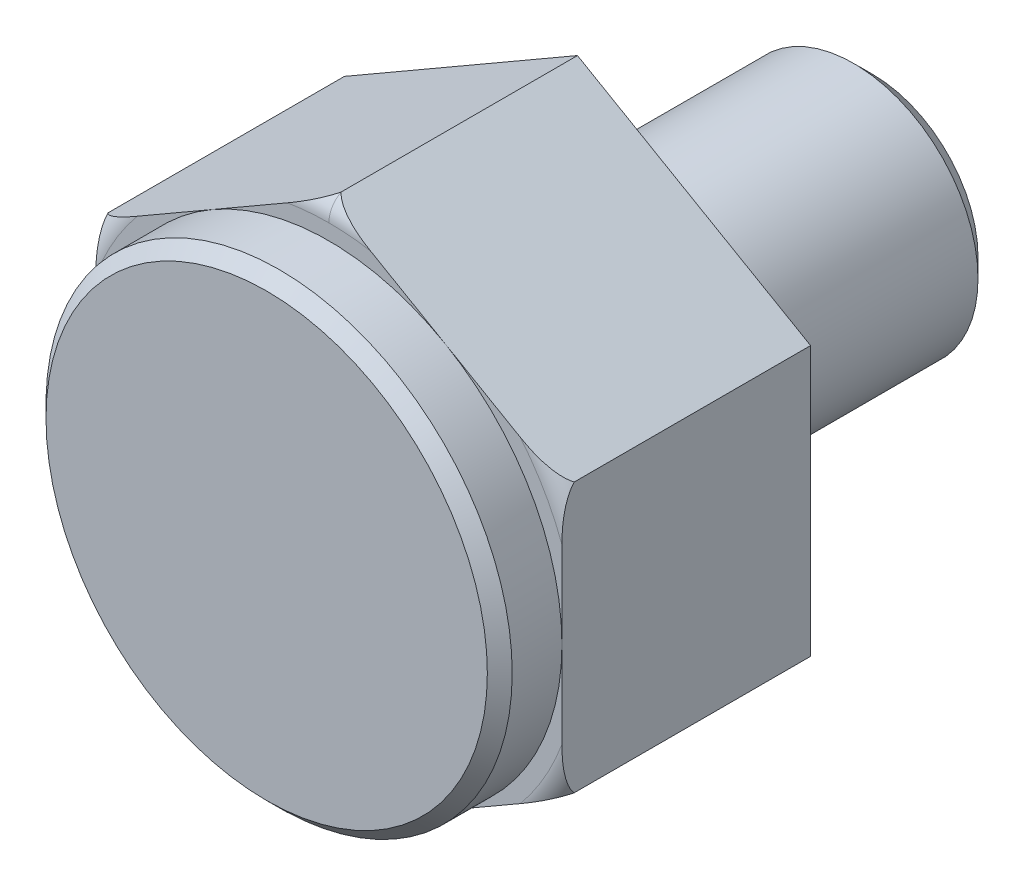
ISO-10303-21;
HEADER;
FILE_DESCRIPTION(('STEP AP214'),'2;1');
FILE_NAME('part.step','',(''),(''),'','','');
FILE_SCHEMA(('AUTOMOTIVE_DESIGN { 1 0 10303 214 1 1 1 1 }'));
ENDSEC;
DATA;
#1=APPLICATION_CONTEXT('core data for automotive mechanical design processes');
#2=APPLICATION_PROTOCOL_DEFINITION('international standard','automotive_design',2000,#1);
#3=PRODUCT_CONTEXT('',#1,'mechanical');
#4=PRODUCT('Part','Part','',(#3));
#5=PRODUCT_RELATED_PRODUCT_CATEGORY('part','',(#4));
#6=PRODUCT_DEFINITION_FORMATION('','',#4);
#7=PRODUCT_DEFINITION_CONTEXT('part definition',#1,'design');
#8=PRODUCT_DEFINITION('design','',#6,#7);
#9=PRODUCT_DEFINITION_SHAPE('','',#8);
#10=(LENGTH_UNIT() NAMED_UNIT(*) SI_UNIT(.MILLI.,.METRE.));
#11=(NAMED_UNIT(*) PLANE_ANGLE_UNIT() SI_UNIT($,.RADIAN.));
#12=(NAMED_UNIT(*) SI_UNIT($,.STERADIAN.) SOLID_ANGLE_UNIT());
#13=UNCERTAINTY_MEASURE_WITH_UNIT(LENGTH_MEASURE(1.E-05),#10,'distance_accuracy_value','');
#14=(GEOMETRIC_REPRESENTATION_CONTEXT(3) GLOBAL_UNCERTAINTY_ASSIGNED_CONTEXT((#13)) GLOBAL_UNIT_ASSIGNED_CONTEXT((#10,
#11,#12)) REPRESENTATION_CONTEXT('',''));
#15=CARTESIAN_POINT('',(0.,0.,0.));
#16=DIRECTION('',(0.,0.,1.));
#17=DIRECTION('',(1.,0.,0.));
#18=AXIS2_PLACEMENT_3D('',#15,#16,#17);
#19=CARTESIAN_POINT('',(6.773,-6.85427810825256,-19.));
#20=DIRECTION('',(0.,0.,-1.));
#21=DIRECTION('',(-1.,0.,0.));
#22=AXIS2_PLACEMENT_3D('',#19,#20,#21);
#23=PLANE('',#22);
#24=CARTESIAN_POINT('',(0.,0.,-19.));
#25=DIRECTION('',(0.,0.,1.));
#26=DIRECTION('',(0.,-1.,0.));
#27=AXIS2_PLACEMENT_3D('',#24,#25,#26);
#28=CIRCLE('',#27,6.773);
#29=CARTESIAN_POINT('',(0.,-6.773,-19.));
#30=VERTEX_POINT('',#29);
#31=EDGE_CURVE('E17',#30,#30,#28,.T.);
#32=ORIENTED_EDGE('',*,*,#31,.F.);
#33=EDGE_LOOP('',(#32));
#34=FACE_BOUND('',#33,.T.);
#35=ADVANCED_FACE('F14',(#34),#23,.T.);
#36=CARTESIAN_POINT('',(0.,0.,-19.));
#37=DIRECTION('',(0.,0.,1.));
#38=DIRECTION('',(0.,-1.,0.));
#39=AXIS2_PLACEMENT_3D('',#36,#37,#38);
#40=CONICAL_SURFACE('',#39,6.773,0.785398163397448);
#41=CARTESIAN_POINT('',(0.,0.,-17.773));
#42=DIRECTION('',(0.,0.,1.));
#43=DIRECTION('',(1.,0.,0.));
#44=AXIS2_PLACEMENT_3D('',#41,#42,#43);
#45=CIRCLE('',#44,8.);
#46=CARTESIAN_POINT('',(8.,0.,-17.773));
#47=VERTEX_POINT('',#46);
#48=EDGE_CURVE('E518',#47,#47,#45,.T.);
#49=ORIENTED_EDGE('',*,*,#48,.F.);
#50=EDGE_LOOP('',(#49));
#51=FACE_BOUND('',#50,.T.);
#52=ORIENTED_EDGE('',*,*,#31,.T.);
#53=EDGE_LOOP('',(#52));
#54=FACE_BOUND('',#53,.T.);
#55=ADVANCED_FACE('F943',(#51,#54),#40,.T.);
#56=CARTESIAN_POINT('',(0.,0.,-4.1));
#57=DIRECTION('',(0.,0.,1.));
#58=DIRECTION('',(0.,-1.,0.));
#59=AXIS2_PLACEMENT_3D('',#56,#57,#58);
#60=CYLINDRICAL_SURFACE('',#59,8.);
#61=CARTESIAN_POINT('',(0.,0.,-4.1));
#62=DIRECTION('',(0.,0.,1.));
#63=DIRECTION('',(1.,0.,0.));
#64=AXIS2_PLACEMENT_3D('',#61,#62,#63);
#65=CIRCLE('',#64,8.);
#66=CARTESIAN_POINT('',(8.,0.,-4.1));
#67=VERTEX_POINT('',#66);
#68=EDGE_CURVE('E515',#67,#67,#65,.T.);
#69=ORIENTED_EDGE('',*,*,#68,.F.);
#70=EDGE_LOOP('',(#69));
#71=FACE_BOUND('',#70,.T.);
#72=ORIENTED_EDGE('',*,*,#48,.T.);
#73=EDGE_LOOP('',(#72));
#74=FACE_BOUND('',#73,.T.);
#75=ADVANCED_FACE('F934',(#71,#74),#60,.T.);
#76=CARTESIAN_POINT('',(0.,0.,-2.5));
#77=DIRECTION('',(0.,0.,-1.));
#78=DIRECTION('',(0.,1.,0.));
#79=AXIS2_PLACEMENT_3D('',#76,#77,#78);
#80=CONICAL_SURFACE('',#79,6.4,0.785398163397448);
#81=CARTESIAN_POINT('',(0.,0.,-2.5));
#82=DIRECTION('',(0.,0.,1.));
#83=DIRECTION('',(1.,0.,0.));
#84=AXIS2_PLACEMENT_3D('',#81,#82,#83);
#85=CIRCLE('',#84,6.4);
#86=CARTESIAN_POINT('',(6.4,0.,-2.5));
#87=VERTEX_POINT('',#86);
#88=EDGE_CURVE('E512',#87,#87,#85,.T.);
#89=ORIENTED_EDGE('',*,*,#88,.F.);
#90=EDGE_LOOP('',(#89));
#91=FACE_BOUND('',#90,.T.);
#92=ORIENTED_EDGE('',*,*,#68,.T.);
#93=EDGE_LOOP('',(#92));
#94=FACE_BOUND('',#93,.T.);
#95=ADVANCED_FACE('F926',(#91,#94),#80,.T.);
#96=CARTESIAN_POINT('',(0.,0.,0.));
#97=DIRECTION('',(0.,0.,1.));
#98=DIRECTION('',(0.,-1.,0.));
#99=AXIS2_PLACEMENT_3D('',#96,#97,#98);
#100=CYLINDRICAL_SURFACE('',#99,6.4);
#101=CARTESIAN_POINT('',(0.,0.,0.));
#102=DIRECTION('',(0.,0.,1.));
#103=DIRECTION('',(0.,-1.,0.));
#104=AXIS2_PLACEMENT_3D('',#101,#102,#103);
#105=CIRCLE('',#104,6.4);
#106=CARTESIAN_POINT('',(0.,-6.4,0.));
#107=VERTEX_POINT('',#106);
#108=EDGE_CURVE('E409',#107,#107,#105,.T.);
#109=ORIENTED_EDGE('',*,*,#108,.F.);
#110=EDGE_LOOP('',(#109));
#111=FACE_BOUND('',#110,.T.);
#112=ORIENTED_EDGE('',*,*,#88,.T.);
#113=EDGE_LOOP('',(#112));
#114=FACE_BOUND('',#113,.T.);
#115=ADVANCED_FACE('F918',(#111,#114),#100,.T.);
#116=CARTESIAN_POINT('',(15.,-17.5283541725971,0.));
#117=DIRECTION('',(0.,0.,-1.));
#118=DIRECTION('',(-1.,0.,0.));
#119=AXIS2_PLACEMENT_3D('',#116,#117,#118);
#120=PLANE('',#119);
#121=ORIENTED_EDGE('',*,*,#108,.T.);
#122=EDGE_LOOP('',(#121));
#123=FACE_BOUND('',#122,.T.);
#124=DIRECTION('',(0.,-1.,0.));
#125=VECTOR('',#124,1.);
#126=CARTESIAN_POINT('',(-15.,0.,0.));
#127=LINE('',#126,#125);
#128=CARTESIAN_POINT('',(-15.,8.66025403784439,0.));
#129=VERTEX_POINT('',#128);
#130=CARTESIAN_POINT('',(-15.,-8.66025403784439,0.));
#131=VERTEX_POINT('',#130);
#132=EDGE_CURVE('E92',#129,#131,#127,.T.);
#133=ORIENTED_EDGE('',*,*,#132,.F.);
#134=DIRECTION('',(-0.866025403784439,-0.5,0.));
#135=VECTOR('',#134,1.);
#136=CARTESIAN_POINT('',(-7.5,12.9903810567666,0.));
#137=LINE('',#136,#135);
#138=CARTESIAN_POINT('',(0.,17.3205080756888,0.));
#139=VERTEX_POINT('',#138);
#140=EDGE_CURVE('E469',#139,#129,#137,.T.);
#141=ORIENTED_EDGE('',*,*,#140,.F.);
#142=DIRECTION('',(-0.866025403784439,0.5,0.));
#143=VECTOR('',#142,1.);
#144=CARTESIAN_POINT('',(7.5,12.9903810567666,0.));
#145=LINE('',#144,#143);
#146=CARTESIAN_POINT('',(15.,8.66025403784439,0.));
#147=VERTEX_POINT('',#146);
#148=EDGE_CURVE('E480',#147,#139,#145,.T.);
#149=ORIENTED_EDGE('',*,*,#148,.F.);
#150=DIRECTION('',(0.,1.,0.));
#151=VECTOR('',#150,1.);
#152=CARTESIAN_POINT('',(15.,0.,0.));
#153=LINE('',#152,#151);
#154=CARTESIAN_POINT('',(15.,-8.66025403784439,0.));
#155=VERTEX_POINT('',#154);
#156=EDGE_CURVE('E493',#155,#147,#153,.T.);
#157=ORIENTED_EDGE('',*,*,#156,.F.);
#158=DIRECTION('',(0.866025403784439,0.5,0.));
#159=VECTOR('',#158,1.);
#160=CARTESIAN_POINT('',(7.5,-12.9903810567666,0.));
#161=LINE('',#160,#159);
#162=CARTESIAN_POINT('',(0.,-17.3205080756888,0.));
#163=VERTEX_POINT('',#162);
#164=EDGE_CURVE('E80',#163,#155,#161,.T.);
#165=ORIENTED_EDGE('',*,*,#164,.F.);
#166=DIRECTION('',(0.866025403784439,-0.5,0.));
#167=VECTOR('',#166,1.);
#168=CARTESIAN_POINT('',(-7.5,-12.9903810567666,0.));
#169=LINE('',#168,#167);
#170=EDGE_CURVE('E86',#131,#163,#169,.T.);
#171=ORIENTED_EDGE('',*,*,#170,.F.);
#172=EDGE_LOOP('',(#133,#141,#149,#157,#165,#171));
#173=FACE_BOUND('',#172,.T.);
#174=ADVANCED_FACE('F415',(#123,#173),#120,.T.);
#175=CARTESIAN_POINT('',(0.,0.,14.5));
#176=DIRECTION('',(0.,0.,1.));
#177=DIRECTION('',(0.,-1.,0.));
#178=AXIS2_PLACEMENT_3D('',#175,#176,#177);
#179=TOROIDAL_SURFACE('',#178,16.,1.5);
#180=CARTESIAN_POINT('',(0.,0.,16.));
#181=DIRECTION('',(0.,0.,-1.));
#182=DIRECTION('',(-0.770114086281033,-0.63790617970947,0.));
#183=AXIS2_PLACEMENT_3D('',#180,#181,#182);
#184=CIRCLE('',#183,16.);
#185=CARTESIAN_POINT('',(-15.,-5.56776436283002,16.));
#186=VERTEX_POINT('',#185);
#187=CARTESIAN_POINT('',(-12.3218252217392,-10.2064989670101,16.));
#188=VERTEX_POINT('',#187);
#189=EDGE_CURVE('E150',#186,#188,#184,.F.);
#190=ORIENTED_EDGE('',*,*,#189,.F.);
#191=CARTESIAN_POINT('',(-15.,-8.66025403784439,15.2115183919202));
#192=CARTESIAN_POINT('',(-15.,-8.62861807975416,15.2408575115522));
#193=CARTESIAN_POINT('',(-15.,-8.59579715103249,15.2688688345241));
#194=CARTESIAN_POINT('',(-15.,-8.52833016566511,15.3223281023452));
#195=CARTESIAN_POINT('',(-15.,-8.49369164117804,15.347785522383));
#196=CARTESIAN_POINT('',(-15.,-8.42291691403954,15.3964297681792));
#197=CARTESIAN_POINT('',(-15.,-8.3867821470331,15.4196187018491));
#198=CARTESIAN_POINT('',(-15.,-8.31379628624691,15.4636265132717));
#199=CARTESIAN_POINT('',(-15.,-8.27696250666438,15.4844742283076));
#200=CARTESIAN_POINT('',(-15.,-8.20228471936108,15.5243539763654));
#201=CARTESIAN_POINT('',(-15.,-8.16443980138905,15.5433842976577));
#202=CARTESIAN_POINT('',(-15.,-8.08793425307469,15.5797638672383));
#203=CARTESIAN_POINT('',(-15.,-8.04927326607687,15.5971123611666));
#204=CARTESIAN_POINT('',(-15.,-7.94056457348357,15.643317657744));
#205=CARTESIAN_POINT('',(-15.,-7.86978963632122,15.6704709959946));
#206=CARTESIAN_POINT('',(-15.,-7.72674107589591,15.7204771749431));
#207=CARTESIAN_POINT('',(-15.,-7.65446709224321,15.743328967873));
#208=CARTESIAN_POINT('',(-15.,-7.50882795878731,15.785272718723));
#209=CARTESIAN_POINT('',(-15.,-7.43546258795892,15.8043639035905));
#210=CARTESIAN_POINT('',(-15.,-7.28703375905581,15.8394468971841));
#211=CARTESIAN_POINT('',(-15.,-7.21196053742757,15.8553970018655));
#212=CARTESIAN_POINT('',(-15.,-7.06126468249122,15.8842827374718));
#213=CARTESIAN_POINT('',(-15.,-6.98564222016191,15.8972192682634));
#214=CARTESIAN_POINT('',(-15.,-6.83399812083,15.92041296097));
#215=CARTESIAN_POINT('',(-15.,-6.75797651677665,15.9306703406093));
#216=CARTESIAN_POINT('',(-15.,-6.58850431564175,15.9508318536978));
#217=CARTESIAN_POINT('',(-15.,-6.49498271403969,15.960136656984));
#218=CARTESIAN_POINT('',(-15.,-6.30768220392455,15.9756022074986));
#219=CARTESIAN_POINT('',(-15.,-6.21390328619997,15.9817628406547));
#220=CARTESIAN_POINT('',(-15.,-6.02807628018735,15.9912303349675));
#221=CARTESIAN_POINT('',(-15.,-5.93603087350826,15.9945915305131));
#222=CARTESIAN_POINT('',(-15.,-5.75190896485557,15.9989729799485));
#223=CARTESIAN_POINT('',(-15.,-5.65983247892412,15.9999938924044));
#224=CARTESIAN_POINT('',(-15.,-5.56776436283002,16.));
#225=B_SPLINE_CURVE_WITH_KNOTS('',3,(#191,#192,#193,#194,#195,#196,#197,#198,#199,#200,#201,
#202,#203,#204,#205,#206,#207,#208,#209,#210,#211,#212,#213,#214,#215,#216,#217,#218,#219,#220,
#221,#222,#223,#224),.UNSPECIFIED.,.F.,.F.,(4,2,2,2,2,2,2,2,2,2,2,2,2,2,2,2,4),(0.,
0.12935344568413,0.258207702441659,0.386941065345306,0.513857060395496,0.640891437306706,
0.767982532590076,0.995217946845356,1.22250863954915,1.44984600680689,1.68002374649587,
1.91013266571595,2.14022287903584,2.42210977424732,2.70400689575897,2.98029599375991,
3.25650733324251),.UNSPECIFIED.);
#226=CARTESIAN_POINT('',(-15.,-8.66025403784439,15.2115183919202));
#227=VERTEX_POINT('',#226);
#228=EDGE_CURVE('E459',#227,#186,#225,.T.);
#229=ORIENTED_EDGE('',*,*,#228,.F.);
#230=CARTESIAN_POINT('',(-12.3218252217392,-10.2064989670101,16.));
#231=CARTESIAN_POINT('',(-12.3933644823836,-10.1651957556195,15.9999961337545));
#232=CARTESIAN_POINT('',(-12.4649083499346,-10.12388988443,15.9991733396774));
#233=CARTESIAN_POINT('',(-12.6080523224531,-10.0412456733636,15.9956676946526));
#234=CARTESIAN_POINT('',(-12.6796523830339,-9.99990735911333,15.9929824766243));
#235=CARTESIAN_POINT('',(-12.8228061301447,-9.9172575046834,15.9855269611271));
#236=CARTESIAN_POINT('',(-12.8943597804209,-9.87594598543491,15.9807557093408));
#237=CARTESIAN_POINT('',(-13.0395042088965,-9.79214681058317,15.9686924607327));
#238=CARTESIAN_POINT('',(-13.1130905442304,-9.74966172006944,15.9613280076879));
#239=CARTESIAN_POINT('',(-13.2599890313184,-9.66484983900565,15.9438029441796));
#240=CARTESIAN_POINT('',(-13.3333012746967,-9.6225229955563,15.9336433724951));
#241=CARTESIAN_POINT('',(-13.4795313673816,-9.53809701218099,15.9101640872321));
#242=CARTESIAN_POINT('',(-13.5524493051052,-9.49599782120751,15.8968451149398));
#243=CARTESIAN_POINT('',(-13.7074626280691,-9.40650083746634,15.8645929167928));
#244=CARTESIAN_POINT('',(-13.7894793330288,-9.35914847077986,15.8451467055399));
#245=CARTESIAN_POINT('',(-13.9524161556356,-9.26507685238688,15.8008855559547));
#246=CARTESIAN_POINT('',(-14.0333365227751,-9.21835745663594,15.7760718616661));
#247=CARTESIAN_POINT('',(-14.1925231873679,-9.12645099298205,15.7204801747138));
#248=CARTESIAN_POINT('',(-14.270810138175,-9.08125200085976,15.6897819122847));
#249=CARTESIAN_POINT('',(-14.4249502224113,-8.99225918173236,15.6210711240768));
#250=CARTESIAN_POINT('',(-14.5008048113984,-8.94846451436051,15.5830630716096));
#251=CARTESIAN_POINT('',(-14.6128819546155,-8.88375674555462,15.5188025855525));
#252=CARTESIAN_POINT('',(-14.6504977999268,-8.86203922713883,15.49577828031));
#253=CARTESIAN_POINT('',(-14.7244333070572,-8.81935254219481,15.4471518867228));
#254=CARTESIAN_POINT('',(-14.7607538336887,-8.79838287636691,15.4215515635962));
#255=CARTESIAN_POINT('',(-14.8321890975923,-8.75713970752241,15.3671809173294));
#256=CARTESIAN_POINT('',(-14.8672852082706,-8.73687695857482,15.3383775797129));
#257=CARTESIAN_POINT('',(-14.935374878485,-8.69756536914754,15.2774833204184));
#258=CARTESIAN_POINT('',(-14.968363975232,-8.67851910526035,15.2453857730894));
#259=CARTESIAN_POINT('',(-15.,-8.66025403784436,15.2115183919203));
#260=B_SPLINE_CURVE_WITH_KNOTS('',3,(#230,#231,#232,#233,#234,#235,#236,#237,#238,#239,#240,
#241,#242,#243,#244,#245,#246,#247,#248,#249,#250,#251,#252,#253,#254,#255,#256,#257,#258,#259),
.UNSPECIFIED.,.F.,.F.,(4,2,2,2,2,2,2,2,2,2,2,2,2,2,4),(0.,0.2478232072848,0.495961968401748,
0.744214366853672,1.00003979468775,1.25577027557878,1.51144081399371,1.80135007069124,
2.09119220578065,2.37735416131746,2.66334155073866,2.81074859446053,2.95805530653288,
3.10705291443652,3.25635630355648),.UNSPECIFIED.);
#261=EDGE_CURVE('E135',#188,#227,#260,.T.);
#262=ORIENTED_EDGE('',*,*,#261,.F.);
#263=EDGE_LOOP('',(#190,#229,#262));
#264=FACE_BOUND('',#263,.T.);
#265=ADVANCED_FACE('F410',(#264),#179,.T.);
#266=CARTESIAN_POINT('',(0.,-17.3205080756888,16.));
#267=DIRECTION('',(-0.5,-0.866025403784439,0.));
#268=DIRECTION('',(-0.866025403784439,0.5,0.));
#269=AXIS2_PLACEMENT_3D('',#266,#267,#268);
#270=PLANE('',#269);
#271=ORIENTED_EDGE('',*,*,#261,.T.);
#272=DIRECTION('',(0.,0.,-1.));
#273=VECTOR('',#272,1.);
#274=CARTESIAN_POINT('',(-15.,-8.6602540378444,16.0003634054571));
#275=LINE('',#274,#273);
#276=EDGE_CURVE('E456',#131,#227,#275,.F.);
#277=ORIENTED_EDGE('',*,*,#276,.F.);
#278=ORIENTED_EDGE('',*,*,#170,.T.);
#279=DIRECTION('',(0.,0.,-1.));
#280=VECTOR('',#279,1.);
#281=CARTESIAN_POINT('',(0.,-17.3205080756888,16.0003634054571));
#282=LINE('',#281,#280);
#283=CARTESIAN_POINT('',(0.,-17.3205080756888,15.2115183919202));
#284=VERTEX_POINT('',#283);
#285=EDGE_CURVE('E132',#284,#163,#282,.T.);
#286=ORIENTED_EDGE('',*,*,#285,.F.);
#287=CARTESIAN_POINT('',(-2.67817486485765,-15.7742630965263,16.));
#288=CARTESIAN_POINT('',(-2.6066356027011,-15.8155663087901,15.9999961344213));
#289=CARTESIAN_POINT('',(-2.53509173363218,-15.8568721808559,15.9991733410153));
#290=CARTESIAN_POINT('',(-2.3919477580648,-15.9395163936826,15.9956676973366));
#291=CARTESIAN_POINT('',(-2.32034769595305,-15.9808547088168,15.9929824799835));
#292=CARTESIAN_POINT('',(-2.17719394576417,-16.0635045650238,15.9855269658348));
#293=CARTESIAN_POINT('',(-2.10564029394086,-16.1048160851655,15.980755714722));
#294=CARTESIAN_POINT('',(-1.96049586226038,-16.1886152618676,15.9686924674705));
#295=CARTESIAN_POINT('',(-1.88690952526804,-16.2311003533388,15.9613280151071));
#296=CARTESIAN_POINT('',(-1.74001103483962,-16.3159122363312,15.9438029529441));
#297=CARTESIAN_POINT('',(-1.66669878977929,-16.3582390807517,15.9336433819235));
#298=CARTESIAN_POINT('',(-1.52046869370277,-16.4426650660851,15.9101640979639));
#299=CARTESIAN_POINT('',(-1.4475507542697,-16.4847642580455,15.8968451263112));
#300=CARTESIAN_POINT('',(-1.29253742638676,-16.5742612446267,15.8645929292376));
#301=CARTESIAN_POINT('',(-1.21052071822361,-16.6216136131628,15.8451467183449));
#302=CARTESIAN_POINT('',(-1.04758388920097,-16.7156852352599,15.8008855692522));
#303=CARTESIAN_POINT('',(-0.96666351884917,-16.7624046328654,15.7760718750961));
#304=CARTESIAN_POINT('',(-0.807476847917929,-16.854311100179,15.7204801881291));
#305=CARTESIAN_POINT('',(-0.729189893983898,-16.899510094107,15.6897819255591));
#306=CARTESIAN_POINT('',(-0.575049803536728,-16.9885029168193,15.6210711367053));
#307=CARTESIAN_POINT('',(-0.499195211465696,-17.0322975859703,15.5830630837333));
#308=CARTESIAN_POINT('',(-0.387118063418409,-17.0970053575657,15.5188025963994));
#309=CARTESIAN_POINT('',(-0.349502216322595,-17.1187228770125,15.4957782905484));
#310=CARTESIAN_POINT('',(-0.275566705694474,-17.1614095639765,15.447151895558));
#311=CARTESIAN_POINT('',(-0.239246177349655,-17.1823792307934,15.4215515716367));
#312=CARTESIAN_POINT('',(-0.167810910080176,-17.223622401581,15.3671809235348));
#313=CARTESIAN_POINT('',(-0.13271479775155,-17.2438851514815,15.3383775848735));
#314=CARTESIAN_POINT('',(-0.0646251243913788,-17.283196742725,15.2774833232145));
#315=CARTESIAN_POINT('',(-0.0316360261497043,-17.3022430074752,15.2453857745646));
#316=CARTESIAN_POINT('',(0.,-17.3205080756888,15.2115183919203));
#317=B_SPLINE_CURVE_WITH_KNOTS('',3,(#287,#288,#289,#290,#291,#292,#293,#294,#295,#296,#297,
#298,#299,#300,#301,#302,#303,#304,#305,#306,#307,#308,#309,#310,#311,#312,#313,#314,#315,#316),
.UNSPECIFIED.,.F.,.F.,(4,2,2,2,2,2,2,2,2,2,2,2,2,2,4),(0.,0.247823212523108,0.495961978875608,
0.744214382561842,1.00003981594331,1.25577030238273,1.51144084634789,1.80135011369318,
2.09119225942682,2.37735422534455,2.66334162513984,2.81074867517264,2.95805539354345,
3.10705300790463,3.25635640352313),.UNSPECIFIED.);
#318=CARTESIAN_POINT('',(-2.67817486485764,-15.7742630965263,16.));
#319=VERTEX_POINT('',#318);
#320=EDGE_CURVE('E71',#319,#284,#317,.T.);
#321=ORIENTED_EDGE('',*,*,#320,.F.);
#322=CARTESIAN_POINT('',(-7.5,-12.9903810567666,16.));
#323=CARTESIAN_POINT('',(-7.29909060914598,-13.1063761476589,16.));
#324=CARTESIAN_POINT('',(-7.09818121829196,-13.2223712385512,16.));
#325=CARTESIAN_POINT('',(-6.69636243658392,-13.4543614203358,16.));
#326=CARTESIAN_POINT('',(-6.4954530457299,-13.570356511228,16.));
#327=CARTESIAN_POINT('',(-6.09363426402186,-13.8023466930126,16.));
#328=CARTESIAN_POINT('',(-5.89272487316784,-13.9183417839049,16.));
#329=CARTESIAN_POINT('',(-5.4909060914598,-14.1503319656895,16.));
#330=CARTESIAN_POINT('',(-5.28999670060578,-14.2663270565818,16.));
#331=CARTESIAN_POINT('',(-4.88817791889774,-14.4983172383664,16.));
#332=CARTESIAN_POINT('',(-4.68726852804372,-14.6143123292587,16.));
#333=CARTESIAN_POINT('',(-4.28544974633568,-14.8463025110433,16.));
#334=CARTESIAN_POINT('',(-4.08454035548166,-14.9622976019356,16.));
#335=CARTESIAN_POINT('',(-3.68272157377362,-15.1942877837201,16.));
#336=CARTESIAN_POINT('',(-3.4818121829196,-15.3102828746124,16.));
#337=CARTESIAN_POINT('',(-3.07999340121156,-15.542273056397,16.));
#338=CARTESIAN_POINT('',(-2.87908401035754,-15.6582681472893,16.));
#339=CARTESIAN_POINT('',(-2.67817461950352,-15.7742632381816,16.));
#340=B_SPLINE_CURVE_WITH_KNOTS('',3,(#322,#323,#324,#325,#326,#327,#328,#329,#330,#331,#332,
#333,#334,#335,#336,#337,#338,#339),.UNSPECIFIED.,.F.,.F.,(4,2,2,2,2,2,2,2,4),(0.,
0.695970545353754,1.39194109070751,2.08791163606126,2.78388218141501,3.47985272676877,
4.17582327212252,4.87179381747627,5.56776436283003),.UNSPECIFIED.);
#341=CARTESIAN_POINT('',(-7.50045448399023,-12.9901184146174,16.));
#342=VERTEX_POINT('',#341);
#343=EDGE_CURVE('E129',#342,#319,#340,.T.);
#344=ORIENTED_EDGE('',*,*,#343,.F.);
#345=CARTESIAN_POINT('',(-12.3218253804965,-10.2064988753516,16.));
#346=CARTESIAN_POINT('',(-12.1209159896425,-10.3224939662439,16.));
#347=CARTESIAN_POINT('',(-11.9200065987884,-10.4384890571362,16.));
#348=CARTESIAN_POINT('',(-11.5181878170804,-10.6704792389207,16.));
#349=CARTESIAN_POINT('',(-11.3172784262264,-10.786474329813,16.));
#350=CARTESIAN_POINT('',(-10.9154596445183,-11.0184645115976,16.));
#351=CARTESIAN_POINT('',(-10.7145502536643,-11.1344596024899,16.));
#352=CARTESIAN_POINT('',(-10.3127314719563,-11.3664497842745,16.));
#353=CARTESIAN_POINT('',(-10.1118220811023,-11.4824448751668,16.));
#354=CARTESIAN_POINT('',(-9.71000329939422,-11.7144350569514,16.));
#355=CARTESIAN_POINT('',(-9.5090939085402,-11.8304301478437,16.));
#356=CARTESIAN_POINT('',(-9.10727512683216,-12.0624203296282,16.));
#357=CARTESIAN_POINT('',(-8.90636573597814,-12.1784154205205,16.));
#358=CARTESIAN_POINT('',(-8.5045469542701,-12.4104056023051,16.));
#359=CARTESIAN_POINT('',(-8.30363756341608,-12.5264006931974,16.));
#360=CARTESIAN_POINT('',(-7.90181878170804,-12.758390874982,16.));
#361=CARTESIAN_POINT('',(-7.70090939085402,-12.8743859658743,16.));
#362=CARTESIAN_POINT('',(-7.5,-12.9903810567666,16.));
#363=B_SPLINE_CURVE_WITH_KNOTS('',3,(#345,#346,#347,#348,#349,#350,#351,#352,#353,#354,#355,
#356,#357,#358,#359,#360,#361,#362),.UNSPECIFIED.,.F.,.F.,(4,2,2,2,2,2,2,2,4),(0.,
0.695970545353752,1.39194109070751,2.08791163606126,2.78388218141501,3.47985272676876,
4.17582327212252,4.87179381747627,5.56776436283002),.UNSPECIFIED.);
#364=EDGE_CURVE('E203',#188,#342,#363,.T.);
#365=ORIENTED_EDGE('',*,*,#364,.F.);
#366=EDGE_LOOP('',(#271,#277,#278,#286,#321,#344,#365));
#367=FACE_BOUND('',#366,.T.);
#368=ADVANCED_FACE('F127',(#367),#270,.T.);
#369=CARTESIAN_POINT('',(0.,0.,14.5));
#370=DIRECTION('',(0.,0.,1.));
#371=DIRECTION('',(0.,-1.,0.));
#372=AXIS2_PLACEMENT_3D('',#369,#370,#371);
#373=TOROIDAL_SURFACE('',#372,16.,1.5);
#374=CARTESIAN_POINT('',(0.,0.,16.));
#375=DIRECTION('',(0.,0.,-1.));
#376=DIRECTION('',(0.,-1.,0.));
#377=AXIS2_PLACEMENT_3D('',#374,#375,#376);
#378=CIRCLE('',#377,16.);
#379=CARTESIAN_POINT('',(0.,-16.,16.));
#380=VERTEX_POINT('',#379);
#381=EDGE_CURVE('E138',#319,#380,#378,.F.);
#382=ORIENTED_EDGE('',*,*,#381,.F.);
#383=ORIENTED_EDGE('',*,*,#320,.T.);
#384=CARTESIAN_POINT('',(0.,-16.,14.5));
#385=DIRECTION('',(1.,0.,0.));
#386=DIRECTION('',(0.,1.,0.));
#387=AXIS2_PLACEMENT_3D('',#384,#385,#386);
#388=CIRCLE('',#387,1.5);
#389=EDGE_CURVE('E134',#380,#284,#388,.T.);
#390=ORIENTED_EDGE('',*,*,#389,.F.);
#391=EDGE_LOOP('',(#382,#383,#390));
#392=FACE_BOUND('',#391,.T.);
#393=ADVANCED_FACE('F140',(#392),#373,.T.);
#394=CARTESIAN_POINT('',(0.,0.,14.5));
#395=DIRECTION('',(0.,0.,1.));
#396=DIRECTION('',(0.,-1.,0.));
#397=AXIS2_PLACEMENT_3D('',#394,#395,#396);
#398=TOROIDAL_SURFACE('',#397,16.,1.5);
#399=CARTESIAN_POINT('',(2.67817486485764,-15.7742630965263,16.));
#400=CARTESIAN_POINT('',(2.60663560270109,-15.81556630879,15.9999961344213));
#401=CARTESIAN_POINT('',(2.53509173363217,-15.8568721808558,15.9991733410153));
#402=CARTESIAN_POINT('',(2.39194775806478,-15.9395163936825,15.9956676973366));
#403=CARTESIAN_POINT('',(2.32034769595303,-15.9808547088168,15.9929824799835));
#404=CARTESIAN_POINT('',(2.17719394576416,-16.0635045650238,15.9855269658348));
#405=CARTESIAN_POINT('',(2.10564029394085,-16.1048160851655,15.980755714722));
#406=CARTESIAN_POINT('',(1.96049586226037,-16.1886152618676,15.9686924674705));
#407=CARTESIAN_POINT('',(1.88690952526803,-16.2311003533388,15.9613280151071));
#408=CARTESIAN_POINT('',(1.74001103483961,-16.3159122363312,15.9438029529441));
#409=CARTESIAN_POINT('',(1.66669878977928,-16.3582390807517,15.9336433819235));
#410=CARTESIAN_POINT('',(1.52046869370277,-16.4426650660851,15.910164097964));
#411=CARTESIAN_POINT('',(1.44755075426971,-16.4847642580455,15.8968451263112));
#412=CARTESIAN_POINT('',(1.29253742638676,-16.5742612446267,15.8645929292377));
#413=CARTESIAN_POINT('',(1.2105207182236,-16.6216136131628,15.8451467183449));
#414=CARTESIAN_POINT('',(1.04758388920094,-16.7156852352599,15.8008855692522));
#415=CARTESIAN_POINT('',(0.966663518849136,-16.7624046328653,15.7760718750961));
#416=CARTESIAN_POINT('',(0.807476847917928,-16.854311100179,15.7204801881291));
#417=CARTESIAN_POINT('',(0.729189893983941,-16.8995100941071,15.6897819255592));
#418=CARTESIAN_POINT('',(0.575049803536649,-16.9885029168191,15.6210711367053));
#419=CARTESIAN_POINT('',(0.499195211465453,-17.0322975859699,15.5830630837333));
#420=CARTESIAN_POINT('',(0.387118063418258,-17.0970053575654,15.5188025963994));
#421=CARTESIAN_POINT('',(0.349502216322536,-17.1187228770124,15.4957782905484));
#422=CARTESIAN_POINT('',(0.275566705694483,-17.1614095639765,15.447151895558));
#423=CARTESIAN_POINT('',(0.239246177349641,-17.1823792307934,15.4215515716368));
#424=CARTESIAN_POINT('',(0.167810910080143,-17.223622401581,15.3671809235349));
#425=CARTESIAN_POINT('',(0.132714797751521,-17.2438851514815,15.3383775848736));
#426=CARTESIAN_POINT('',(0.0646251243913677,-17.283196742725,15.2774833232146));
#427=CARTESIAN_POINT('',(0.0316360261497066,-17.3022430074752,15.2453857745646));
#428=CARTESIAN_POINT('',(0.,-17.3205080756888,15.2115183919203));
#429=B_SPLINE_CURVE_WITH_KNOTS('',3,(#399,#400,#401,#402,#403,#404,#405,#406,#407,#408,#409,
#410,#411,#412,#413,#414,#415,#416,#417,#418,#419,#420,#421,#422,#423,#424,#425,#426,#427,#428),
.UNSPECIFIED.,.F.,.F.,(4,2,2,2,2,2,2,2,2,2,2,2,2,2,4),(0.,0.247823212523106,0.495961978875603,
0.744214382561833,1.0000398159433,1.25577030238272,1.51144084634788,1.80135011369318,
2.09119225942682,2.37735422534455,2.66334162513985,2.81074867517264,2.95805539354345,
3.10705300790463,3.25635640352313),.UNSPECIFIED.);
#430=CARTESIAN_POINT('',(2.67817486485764,-15.7742630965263,16.));
#431=VERTEX_POINT('',#430);
#432=EDGE_CURVE('E506',#431,#284,#429,.T.);
#433=ORIENTED_EDGE('',*,*,#432,.F.);
#434=CARTESIAN_POINT('',(0.,0.,16.));
#435=DIRECTION('',(0.,0.,-1.));
#436=DIRECTION('',(0.167385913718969,-0.98589145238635,0.));
#437=AXIS2_PLACEMENT_3D('',#434,#435,#436);
#438=CIRCLE('',#437,16.);
#439=EDGE_CURVE('E144',#380,#431,#438,.F.);
#440=ORIENTED_EDGE('',*,*,#439,.F.);
#441=ORIENTED_EDGE('',*,*,#389,.T.);
#442=EDGE_LOOP('',(#433,#440,#441));
#443=FACE_BOUND('',#442,.T.);
#444=ADVANCED_FACE('F386',(#443),#398,.T.);
#445=CARTESIAN_POINT('',(15.,-8.66025403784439,16.));
#446=DIRECTION('',(0.5,-0.866025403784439,0.));
#447=DIRECTION('',(-0.866025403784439,-0.5,0.));
#448=AXIS2_PLACEMENT_3D('',#445,#446,#447);
#449=PLANE('',#448);
#450=ORIENTED_EDGE('',*,*,#432,.T.);
#451=ORIENTED_EDGE('',*,*,#285,.T.);
#452=ORIENTED_EDGE('',*,*,#164,.T.);
#453=DIRECTION('',(0.,0.,-1.));
#454=VECTOR('',#453,1.);
#455=CARTESIAN_POINT('',(15.,-8.6602540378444,16.0003634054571));
#456=LINE('',#455,#454);
#457=CARTESIAN_POINT('',(15.,-8.66025403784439,15.2115183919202));
#458=VERTEX_POINT('',#457);
#459=EDGE_CURVE('E500',#458,#155,#456,.T.);
#460=ORIENTED_EDGE('',*,*,#459,.F.);
#461=CARTESIAN_POINT('',(12.3218252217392,-10.2064989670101,16.));
#462=CARTESIAN_POINT('',(12.3933644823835,-10.1651957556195,15.9999961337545));
#463=CARTESIAN_POINT('',(12.4649083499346,-10.12388988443,15.9991733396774));
#464=CARTESIAN_POINT('',(12.6080523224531,-10.0412456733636,15.9956676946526));
#465=CARTESIAN_POINT('',(12.6796523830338,-9.99990735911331,15.9929824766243));
#466=CARTESIAN_POINT('',(12.8228061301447,-9.91725750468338,15.9855269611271));
#467=CARTESIAN_POINT('',(12.8943597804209,-9.87594598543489,15.9807557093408));
#468=CARTESIAN_POINT('',(13.0395042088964,-9.79214681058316,15.9686924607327));
#469=CARTESIAN_POINT('',(13.1130905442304,-9.74966172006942,15.961328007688));
#470=CARTESIAN_POINT('',(13.2599890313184,-9.66484983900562,15.9438029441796));
#471=CARTESIAN_POINT('',(13.3333012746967,-9.62252299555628,15.9336433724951));
#472=CARTESIAN_POINT('',(13.4795313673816,-9.53809701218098,15.9101640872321));
#473=CARTESIAN_POINT('',(13.5524493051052,-9.49599782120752,15.8968451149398));
#474=CARTESIAN_POINT('',(13.7074626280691,-9.40650083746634,15.8645929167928));
#475=CARTESIAN_POINT('',(13.7894793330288,-9.35914847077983,15.8451467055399));
#476=CARTESIAN_POINT('',(13.9524161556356,-9.26507685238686,15.8008855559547));
#477=CARTESIAN_POINT('',(14.0333365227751,-9.21835745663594,15.7760718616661));
#478=CARTESIAN_POINT('',(14.1925231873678,-9.12645099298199,15.7204801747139));
#479=CARTESIAN_POINT('',(14.2708101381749,-9.08125200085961,15.6897819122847));
#480=CARTESIAN_POINT('',(14.4249502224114,-8.99225918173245,15.6210711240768));
#481=CARTESIAN_POINT('',(14.5008048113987,-8.94846451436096,15.5830630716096));
#482=CARTESIAN_POINT('',(14.6128819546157,-8.88375674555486,15.5188025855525));
#483=CARTESIAN_POINT('',(14.6504977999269,-8.86203922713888,15.49577828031));
#484=CARTESIAN_POINT('',(14.7244333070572,-8.81935254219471,15.4471518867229));
#485=CARTESIAN_POINT('',(14.7607538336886,-8.79838287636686,15.4215515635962));
#486=CARTESIAN_POINT('',(14.8321890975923,-8.7571397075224,15.3671809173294));
#487=CARTESIAN_POINT('',(14.8672852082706,-8.7368769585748,15.3383775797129));
#488=CARTESIAN_POINT('',(14.935374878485,-8.6975653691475,15.2774833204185));
#489=CARTESIAN_POINT('',(14.968363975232,-8.67851910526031,15.2453857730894));
#490=CARTESIAN_POINT('',(15.,-8.66025403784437,15.2115183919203));
#491=B_SPLINE_CURVE_WITH_KNOTS('',3,(#461,#462,#463,#464,#465,#466,#467,#468,#469,#470,#471,
#472,#473,#474,#475,#476,#477,#478,#479,#480,#481,#482,#483,#484,#485,#486,#487,#488,#489,#490),
.UNSPECIFIED.,.F.,.F.,(4,2,2,2,2,2,2,2,2,2,2,2,2,2,4),(0.,0.247823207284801,0.495961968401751,
0.744214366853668,1.00003979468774,1.25577027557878,1.51144081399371,1.80135007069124,
2.09119220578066,2.37735416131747,2.66334155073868,2.81074859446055,2.95805530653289,
3.10705291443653,3.25635630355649),.UNSPECIFIED.);
#492=CARTESIAN_POINT('',(12.3218252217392,-10.2064989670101,16.));
#493=VERTEX_POINT('',#492);
#494=EDGE_CURVE('E497',#493,#458,#491,.T.);
#495=ORIENTED_EDGE('',*,*,#494,.F.);
#496=CARTESIAN_POINT('',(7.5,-12.9903810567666,16.));
#497=CARTESIAN_POINT('',(7.70090939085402,-12.8743859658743,16.));
#498=CARTESIAN_POINT('',(7.90181878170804,-12.758390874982,16.));
#499=CARTESIAN_POINT('',(8.30363756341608,-12.5264006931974,16.));
#500=CARTESIAN_POINT('',(8.5045469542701,-12.4104056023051,16.));
#501=CARTESIAN_POINT('',(8.90636573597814,-12.1784154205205,16.));
#502=CARTESIAN_POINT('',(9.10727512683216,-12.0624203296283,16.));
#503=CARTESIAN_POINT('',(9.5090939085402,-11.8304301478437,16.));
#504=CARTESIAN_POINT('',(9.71000329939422,-11.7144350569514,16.));
#505=CARTESIAN_POINT('',(10.1118220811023,-11.4824448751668,16.));
#506=CARTESIAN_POINT('',(10.3127314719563,-11.3664497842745,16.));
#507=CARTESIAN_POINT('',(10.7145502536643,-11.1344596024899,16.));
#508=CARTESIAN_POINT('',(10.9154596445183,-11.0184645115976,16.));
#509=CARTESIAN_POINT('',(11.3172784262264,-10.786474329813,16.));
#510=CARTESIAN_POINT('',(11.5181878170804,-10.6704792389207,16.));
#511=CARTESIAN_POINT('',(11.9200065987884,-10.4384890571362,16.));
#512=CARTESIAN_POINT('',(12.1209159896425,-10.3224939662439,16.));
#513=CARTESIAN_POINT('',(12.3218253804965,-10.2064988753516,16.));
#514=B_SPLINE_CURVE_WITH_KNOTS('',3,(#496,#497,#498,#499,#500,#501,#502,#503,#504,#505,#506,
#507,#508,#509,#510,#511,#512,#513),.UNSPECIFIED.,.F.,.F.,(4,2,2,2,2,2,2,2,4),(0.,
0.695970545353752,1.39194109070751,2.08791163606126,2.78388218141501,3.47985272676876,
4.17582327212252,4.87179381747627,5.56776436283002),.UNSPECIFIED.);
#515=CARTESIAN_POINT('',(7.49954505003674,-12.9906434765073,16.));
#516=VERTEX_POINT('',#515);
#517=EDGE_CURVE('E342',#516,#493,#514,.T.);
#518=ORIENTED_EDGE('',*,*,#517,.F.);
#519=CARTESIAN_POINT('',(2.67817461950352,-15.7742632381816,16.));
#520=CARTESIAN_POINT('',(2.87908401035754,-15.6582681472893,16.));
#521=CARTESIAN_POINT('',(3.07999340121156,-15.542273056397,16.));
#522=CARTESIAN_POINT('',(3.4818121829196,-15.3102828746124,16.));
#523=CARTESIAN_POINT('',(3.68272157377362,-15.1942877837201,16.));
#524=CARTESIAN_POINT('',(4.08454035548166,-14.9622976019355,16.));
#525=CARTESIAN_POINT('',(4.28544974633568,-14.8463025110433,16.));
#526=CARTESIAN_POINT('',(4.68726852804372,-14.6143123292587,16.));
#527=CARTESIAN_POINT('',(4.88817791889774,-14.4983172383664,16.));
#528=CARTESIAN_POINT('',(5.28999670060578,-14.2663270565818,16.));
#529=CARTESIAN_POINT('',(5.4909060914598,-14.1503319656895,16.));
#530=CARTESIAN_POINT('',(5.89272487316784,-13.9183417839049,16.));
#531=CARTESIAN_POINT('',(6.09363426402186,-13.8023466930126,16.));
#532=CARTESIAN_POINT('',(6.4954530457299,-13.570356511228,16.));
#533=CARTESIAN_POINT('',(6.69636243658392,-13.4543614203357,16.));
#534=CARTESIAN_POINT('',(7.09818121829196,-13.2223712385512,16.));
#535=CARTESIAN_POINT('',(7.29909060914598,-13.1063761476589,16.));
#536=CARTESIAN_POINT('',(7.5,-12.9903810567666,16.));
#537=B_SPLINE_CURVE_WITH_KNOTS('',3,(#519,#520,#521,#522,#523,#524,#525,#526,#527,#528,#529,
#530,#531,#532,#533,#534,#535,#536),.UNSPECIFIED.,.F.,.F.,(4,2,2,2,2,2,2,2,4),(0.,
0.695970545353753,1.39194109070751,2.08791163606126,2.78388218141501,3.47985272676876,
4.17582327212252,4.87179381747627,5.56776436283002),.UNSPECIFIED.);
#538=EDGE_CURVE('E148',#431,#516,#537,.T.);
#539=ORIENTED_EDGE('',*,*,#538,.F.);
#540=EDGE_LOOP('',(#450,#451,#452,#460,#495,#518,#539));
#541=FACE_BOUND('',#540,.T.);
#542=ADVANCED_FACE('F683',(#541),#449,.T.);
#543=CARTESIAN_POINT('',(0.,0.,14.5));
#544=DIRECTION('',(0.,0.,1.));
#545=DIRECTION('',(0.,-1.,0.));
#546=AXIS2_PLACEMENT_3D('',#543,#544,#545);
#547=TOROIDAL_SURFACE('',#546,16.,1.5);
#548=CARTESIAN_POINT('',(0.,0.,16.));
#549=DIRECTION('',(0.,0.,-1.));
#550=DIRECTION('',(0.9375,-0.347985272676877,0.));
#551=AXIS2_PLACEMENT_3D('',#548,#549,#550);
#552=CIRCLE('',#551,16.);
#553=CARTESIAN_POINT('',(15.,-5.56776436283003,16.));
#554=VERTEX_POINT('',#553);
#555=EDGE_CURVE('E364',#493,#554,#552,.F.);
#556=ORIENTED_EDGE('',*,*,#555,.F.);
#557=ORIENTED_EDGE('',*,*,#494,.T.);
#558=CARTESIAN_POINT('',(15.,-5.56776436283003,16.));
#559=CARTESIAN_POINT('',(15.,-5.65037078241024,15.9999961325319));
#560=CARTESIAN_POINT('',(15.,-5.73298252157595,15.9991733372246));
#561=CARTESIAN_POINT('',(15.,-5.89827093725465,15.9956676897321));
#562=CARTESIAN_POINT('',(15.,-5.98094756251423,15.9929824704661));
#563=CARTESIAN_POINT('',(15.,-6.14624726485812,15.9855269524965));
#564=CARTESIAN_POINT('',(15.,-6.22887030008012,15.9807556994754));
#565=CARTESIAN_POINT('',(15.,-6.39646864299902,15.9686924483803));
#566=CARTESIAN_POINT('',(15.,-6.48143882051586,15.9613279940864));
#567=CARTESIAN_POINT('',(15.,-6.65106257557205,15.9438029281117));
#568=CARTESIAN_POINT('',(15.,-6.73571625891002,15.93364335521));
#569=CARTESIAN_POINT('',(15.,-6.90456821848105,15.9101640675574));
#570=CARTESIAN_POINT('',(15.,-6.98876659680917,15.8968450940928));
#571=CARTESIAN_POINT('',(15.,-7.16776055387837,15.8645928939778));
#572=CARTESIAN_POINT('',(15.,-7.2624652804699,15.8451466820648));
#573=CARTESIAN_POINT('',(15.,-7.45060850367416,15.8008855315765));
#574=CARTESIAN_POINT('',(14.9999999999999,-7.54404728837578,15.7760718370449));
#575=CARTESIAN_POINT('',(15.0000000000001,-7.72786020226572,15.7204801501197));
#576=CARTESIAN_POINT('',(15.0000000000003,-7.81825817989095,15.6897818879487));
#577=CARTESIAN_POINT('',(14.9999999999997,-7.996243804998,15.6210711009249));
#578=CARTESIAN_POINT('',(14.999999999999,-8.08383313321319,15.5830630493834));
#579=CARTESIAN_POINT('',(14.9999999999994,-8.21324866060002,15.5188025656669));
#580=CARTESIAN_POINT('',(14.9999999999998,-8.25668369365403,15.49577826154));
#581=CARTESIAN_POINT('',(15.0000000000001,-8.3420570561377,15.4471518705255));
#582=CARTESIAN_POINT('',(15.,-8.38399638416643,15.4215515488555));
#583=CARTESIAN_POINT('',(15.,-8.46648271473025,15.367180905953));
#584=CARTESIAN_POINT('',(15.,-8.50700820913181,15.3383775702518));
#585=CARTESIAN_POINT('',(15.,-8.58563138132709,15.2774833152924));
#586=CARTESIAN_POINT('',(15.,-8.62372390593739,15.245385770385));
#587=CARTESIAN_POINT('',(15.,-8.6602540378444,15.2115183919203));
#588=B_SPLINE_CURVE_WITH_KNOTS('',3,(#558,#559,#560,#561,#562,#563,#564,#565,#566,#567,#568,
#569,#570,#571,#572,#573,#574,#575,#576,#577,#578,#579,#580,#581,#582,#583,#584,#585,#586,#587),
.UNSPECIFIED.,.F.,.F.,(4,2,2,2,2,2,2,2,2,2,2,2,2,2,4),(0.,0.247823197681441,0.495961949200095,
0.74421433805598,1.00003975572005,1.25577022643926,1.51144075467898,1.80134999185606,
2.0911921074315,2.37735404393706,2.66334141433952,2.81074844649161,2.958055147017,
3.10705274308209,3.25635612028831),.UNSPECIFIED.);
#589=EDGE_CURVE('E496',#554,#458,#588,.T.);
#590=ORIENTED_EDGE('',*,*,#589,.F.);
#591=EDGE_LOOP('',(#556,#557,#590));
#592=FACE_BOUND('',#591,.T.);
#593=ADVANCED_FACE('F680',(#592),#547,.T.);
#594=CARTESIAN_POINT('',(15.,8.66025403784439,16.));
#595=DIRECTION('',(1.,0.,0.));
#596=DIRECTION('',(0.,-1.,0.));
#597=AXIS2_PLACEMENT_3D('',#594,#595,#596);
#598=PLANE('',#597);
#599=ORIENTED_EDGE('',*,*,#589,.T.);
#600=ORIENTED_EDGE('',*,*,#459,.T.);
#601=ORIENTED_EDGE('',*,*,#156,.T.);
#602=DIRECTION('',(0.,0.,-1.));
#603=VECTOR('',#602,1.);
#604=CARTESIAN_POINT('',(15.,8.66025403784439,16.0003634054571));
#605=LINE('',#604,#603);
#606=CARTESIAN_POINT('',(15.,8.66025403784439,15.2115183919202));
#607=VERTEX_POINT('',#606);
#608=EDGE_CURVE('E487',#607,#147,#605,.T.);
#609=ORIENTED_EDGE('',*,*,#608,.F.);
#610=CARTESIAN_POINT('',(15.,5.56776436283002,16.));
#611=CARTESIAN_POINT('',(15.,5.65037078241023,15.9999961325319));
#612=CARTESIAN_POINT('',(15.,5.73298252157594,15.9991733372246));
#613=CARTESIAN_POINT('',(15.,5.89827093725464,15.9956676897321));
#614=CARTESIAN_POINT('',(15.,5.98094756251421,15.9929824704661));
#615=CARTESIAN_POINT('',(15.,6.14624726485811,15.9855269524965));
#616=CARTESIAN_POINT('',(15.,6.22887030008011,15.9807556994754));
#617=CARTESIAN_POINT('',(15.,6.39646864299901,15.9686924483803));
#618=CARTESIAN_POINT('',(15.,6.48143882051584,15.9613279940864));
#619=CARTESIAN_POINT('',(15.,6.65106257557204,15.9438029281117));
#620=CARTESIAN_POINT('',(15.,6.73571625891,15.93364335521));
#621=CARTESIAN_POINT('',(15.,6.90456821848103,15.9101640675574));
#622=CARTESIAN_POINT('',(15.,6.98876659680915,15.8968450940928));
#623=CARTESIAN_POINT('',(15.,7.16776055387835,15.8645928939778));
#624=CARTESIAN_POINT('',(15.,7.26246528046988,15.8451466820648));
#625=CARTESIAN_POINT('',(15.,7.45060850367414,15.8008855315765));
#626=CARTESIAN_POINT('',(15.,7.54404728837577,15.7760718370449));
#627=CARTESIAN_POINT('',(15.,7.72786020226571,15.7204801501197));
#628=CARTESIAN_POINT('',(15.0000000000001,7.81825817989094,15.6897818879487));
#629=CARTESIAN_POINT('',(14.9999999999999,7.99624380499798,15.6210711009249));
#630=CARTESIAN_POINT('',(14.9999999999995,8.08383313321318,15.5830630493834));
#631=CARTESIAN_POINT('',(14.9999999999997,8.21324866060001,15.5188025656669));
#632=CARTESIAN_POINT('',(14.9999999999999,8.25668369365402,15.49577826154));
#633=CARTESIAN_POINT('',(15.0000000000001,8.34205705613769,15.4471518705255));
#634=CARTESIAN_POINT('',(15.,8.38399638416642,15.4215515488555));
#635=CARTESIAN_POINT('',(15.,8.46648271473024,15.367180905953));
#636=CARTESIAN_POINT('',(15.,8.5070082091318,15.3383775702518));
#637=CARTESIAN_POINT('',(15.,8.58563138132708,15.2774833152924));
#638=CARTESIAN_POINT('',(15.,8.62372390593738,15.245385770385));
#639=CARTESIAN_POINT('',(15.,8.66025403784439,15.2115183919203));
#640=B_SPLINE_CURVE_WITH_KNOTS('',3,(#610,#611,#612,#613,#614,#615,#616,#617,#618,#619,#620,
#621,#622,#623,#624,#625,#626,#627,#628,#629,#630,#631,#632,#633,#634,#635,#636,#637,#638,#639),
.UNSPECIFIED.,.F.,.F.,(4,2,2,2,2,2,2,2,2,2,2,2,2,2,4),(0.,0.24782319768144,0.495961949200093,
0.744214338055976,1.00003975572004,1.25577022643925,1.51144075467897,1.80134999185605,
2.0911921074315,2.37735404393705,2.66334141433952,2.81074844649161,2.958055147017,
3.10705274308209,3.25635612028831),.UNSPECIFIED.);
#641=CARTESIAN_POINT('',(15.,5.56776436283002,16.));
#642=VERTEX_POINT('',#641);
#643=EDGE_CURVE('E484',#642,#607,#640,.T.);
#644=ORIENTED_EDGE('',*,*,#643,.F.);
#645=DIRECTION('',(0.,1.,0.));
#646=VECTOR('',#645,1.);
#647=CARTESIAN_POINT('',(15.,0.,16.));
#648=LINE('',#647,#646);
#649=CARTESIAN_POINT('',(15.,0.,16.));
#650=VERTEX_POINT('',#649);
#651=EDGE_CURVE('E316',#650,#642,#648,.T.);
#652=ORIENTED_EDGE('',*,*,#651,.F.);
#653=DIRECTION('',(0.,1.,0.));
#654=VECTOR('',#653,1.);
#655=CARTESIAN_POINT('',(15.,-12.9903810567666,16.));
#656=LINE('',#655,#654);
#657=EDGE_CURVE('E351',#554,#650,#656,.T.);
#658=ORIENTED_EDGE('',*,*,#657,.F.);
#659=EDGE_LOOP('',(#599,#600,#601,#609,#644,#652,#658));
#660=FACE_BOUND('',#659,.T.);
#661=ADVANCED_FACE('F638',(#660),#598,.T.);
#662=CARTESIAN_POINT('',(0.,0.,14.5));
#663=DIRECTION('',(0.,0.,1.));
#664=DIRECTION('',(0.,-1.,0.));
#665=AXIS2_PLACEMENT_3D('',#662,#663,#664);
#666=TOROIDAL_SURFACE('',#665,16.,1.5);
#667=CARTESIAN_POINT('',(12.3218253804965,10.2064988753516,16.));
#668=CARTESIAN_POINT('',(12.3933646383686,10.1651956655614,15.9999961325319));
#669=CARTESIAN_POINT('',(12.4649085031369,10.1238897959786,15.9991733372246));
#670=CARTESIAN_POINT('',(12.608052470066,10.0412455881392,15.9956676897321));
#671=CARTESIAN_POINT('',(12.6796525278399,9.99990727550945,15.9929824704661));
#672=CARTESIAN_POINT('',(12.8228062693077,9.9172574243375,15.9855269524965));
#673=CARTESIAN_POINT('',(12.8943599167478,9.87594590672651,15.9807556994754));
#674=CARTESIAN_POINT('',(13.0395043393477,9.79214673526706,15.9686924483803));
#675=CARTESIAN_POINT('',(13.1130906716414,9.74966164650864,15.9613279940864));
#676=CARTESIAN_POINT('',(13.2599891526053,9.66484976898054,15.9438029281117));
#677=CARTESIAN_POINT('',(13.3333013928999,9.62252292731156,15.93364335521));
#678=CARTESIAN_POINT('',(13.4795314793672,9.53809694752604,15.9101640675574));
#679=CARTESIAN_POINT('',(13.5524494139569,9.49599775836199,15.8968450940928));
#680=CARTESIAN_POINT('',(13.7074627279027,9.4065007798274,15.8645928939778));
#681=CARTESIAN_POINT('',(13.7894794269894,9.35914841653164,15.8451466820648));
#682=CARTESIAN_POINT('',(13.9524162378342,9.26507680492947,15.8008855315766));
#683=CARTESIAN_POINT('',(14.0333365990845,9.21835741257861,15.776071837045));
#684=CARTESIAN_POINT('',(14.1925232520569,9.12645095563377,15.7204801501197));
#685=CARTESIAN_POINT('',(14.2708101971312,9.08125196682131,15.6897818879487));
#686=CARTESIAN_POINT('',(14.4249502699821,8.99225915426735,15.6210711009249));
#687=CARTESIAN_POINT('',(14.5008048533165,8.94846449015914,15.5830630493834));
#688=CARTESIAN_POINT('',(14.6128819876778,8.88375672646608,15.5188025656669));
#689=CARTESIAN_POINT('',(14.650497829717,8.86203920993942,15.49577826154));
#690=CARTESIAN_POINT('',(14.7244333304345,8.81935252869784,15.4471518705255));
#691=CARTESIAN_POINT('',(14.760753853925,8.79838286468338,15.4215515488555));
#692=CARTESIAN_POINT('',(14.8321891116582,8.7571396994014,15.367180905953));
#693=CARTESIAN_POINT('',(14.8672852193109,8.73687695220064,15.3383775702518));
#694=CARTESIAN_POINT('',(14.9353748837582,8.69756536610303,15.2774833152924));
#695=CARTESIAN_POINT('',(14.968363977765,8.6785191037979,15.245385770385));
#696=CARTESIAN_POINT('',(15.,8.66025403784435,15.2115183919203));
#697=B_SPLINE_CURVE_WITH_KNOTS('',3,(#667,#668,#669,#670,#671,#672,#673,#674,#675,#676,#677,
#678,#679,#680,#681,#682,#683,#684,#685,#686,#687,#688,#689,#690,#691,#692,#693,#694,#695,#696),
.UNSPECIFIED.,.F.,.F.,(4,2,2,2,2,2,2,2,2,2,2,2,2,2,4),(0.,0.247823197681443,0.495961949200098,
0.744214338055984,1.00003975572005,1.25577022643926,1.51144075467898,1.80134999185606,
2.09119210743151,2.37735404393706,2.66334141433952,2.81074844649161,2.95805514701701,
3.10705274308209,3.25635612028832),.UNSPECIFIED.);
#698=CARTESIAN_POINT('',(12.3218253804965,10.2064988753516,16.));
#699=VERTEX_POINT('',#698);
#700=EDGE_CURVE('E483',#699,#607,#697,.T.);
#701=ORIENTED_EDGE('',*,*,#700,.F.);
#702=CARTESIAN_POINT('',(0.,0.,16.));
#703=DIRECTION('',(0.,0.,-1.));
#704=DIRECTION('',(0.77011408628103,0.637906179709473,0.));
#705=AXIS2_PLACEMENT_3D('',#702,#703,#704);
#706=CIRCLE('',#705,16.);
#707=EDGE_CURVE('E667',#642,#699,#706,.F.);
#708=ORIENTED_EDGE('',*,*,#707,.F.);
#709=ORIENTED_EDGE('',*,*,#643,.T.);
#710=EDGE_LOOP('',(#701,#708,#709));
#711=FACE_BOUND('',#710,.T.);
#712=ADVANCED_FACE('F633',(#711),#666,.T.);
#713=CARTESIAN_POINT('',(0.,17.3205080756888,16.));
#714=DIRECTION('',(0.5,0.866025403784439,0.));
#715=DIRECTION('',(0.866025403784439,-0.5,0.));
#716=AXIS2_PLACEMENT_3D('',#713,#714,#715);
#717=PLANE('',#716);
#718=ORIENTED_EDGE('',*,*,#700,.T.);
#719=ORIENTED_EDGE('',*,*,#608,.T.);
#720=ORIENTED_EDGE('',*,*,#148,.T.);
#721=DIRECTION('',(0.,0.,-1.));
#722=VECTOR('',#721,1.);
#723=CARTESIAN_POINT('',(0.,17.3205080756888,16.0003634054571));
#724=LINE('',#723,#722);
#725=CARTESIAN_POINT('',(0.,17.3205080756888,15.2115183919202));
#726=VERTEX_POINT('',#725);
#727=EDGE_CURVE('E475',#726,#139,#724,.T.);
#728=ORIENTED_EDGE('',*,*,#727,.F.);
#729=CARTESIAN_POINT('',(2.67817486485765,15.7742630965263,16.));
#730=CARTESIAN_POINT('',(2.6066356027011,15.81556630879,15.9999961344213));
#731=CARTESIAN_POINT('',(2.53509173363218,15.8568721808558,15.9991733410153));
#732=CARTESIAN_POINT('',(2.3919477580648,15.9395163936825,15.9956676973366));
#733=CARTESIAN_POINT('',(2.32034769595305,15.9808547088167,15.9929824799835));
#734=CARTESIAN_POINT('',(2.17719394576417,16.0635045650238,15.9855269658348));
#735=CARTESIAN_POINT('',(2.10564029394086,16.1048160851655,15.980755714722));
#736=CARTESIAN_POINT('',(1.96049586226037,16.1886152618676,15.9686924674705));
#737=CARTESIAN_POINT('',(1.88690952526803,16.2311003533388,15.9613280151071));
#738=CARTESIAN_POINT('',(1.74001103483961,16.3159122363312,15.9438029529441));
#739=CARTESIAN_POINT('',(1.66669878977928,16.3582390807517,15.9336433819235));
#740=CARTESIAN_POINT('',(1.52046869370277,16.4426650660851,15.910164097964));
#741=CARTESIAN_POINT('',(1.44755075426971,16.4847642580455,15.8968451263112));
#742=CARTESIAN_POINT('',(1.29253742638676,16.5742612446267,15.8645929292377));
#743=CARTESIAN_POINT('',(1.21052071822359,16.6216136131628,15.8451467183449));
#744=CARTESIAN_POINT('',(1.04758388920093,16.7156852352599,15.8008855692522));
#745=CARTESIAN_POINT('',(0.96666351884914,16.7624046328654,15.7760718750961));
#746=CARTESIAN_POINT('',(0.807476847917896,16.854311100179,15.7204801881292));
#747=CARTESIAN_POINT('',(0.729189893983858,16.899510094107,15.6897819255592));
#748=CARTESIAN_POINT('',(0.575049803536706,16.9885029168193,15.6210711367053));
#749=CARTESIAN_POINT('',(0.4991952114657,17.0322975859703,15.5830630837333));
#750=CARTESIAN_POINT('',(0.387118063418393,17.0970053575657,15.5188025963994));
#751=CARTESIAN_POINT('',(0.349502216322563,17.1187228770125,15.4957782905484));
#752=CARTESIAN_POINT('',(0.275566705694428,17.1614095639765,15.447151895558));
#753=CARTESIAN_POINT('',(0.239246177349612,17.1823792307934,15.4215515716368));
#754=CARTESIAN_POINT('',(0.167810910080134,17.223622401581,15.3671809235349));
#755=CARTESIAN_POINT('',(0.132714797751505,17.2438851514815,15.3383775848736));
#756=CARTESIAN_POINT('',(0.0646251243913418,17.283196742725,15.2774833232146));
#757=CARTESIAN_POINT('',(0.0316360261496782,17.3022430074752,15.2453857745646));
#758=CARTESIAN_POINT('',(0.,17.3205080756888,15.2115183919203));
#759=B_SPLINE_CURVE_WITH_KNOTS('',3,(#729,#730,#731,#732,#733,#734,#735,#736,#737,#738,#739,
#740,#741,#742,#743,#744,#745,#746,#747,#748,#749,#750,#751,#752,#753,#754,#755,#756,#757,#758),
.UNSPECIFIED.,.F.,.F.,(4,2,2,2,2,2,2,2,2,2,2,2,2,2,4),(0.,0.247823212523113,0.495961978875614,
0.744214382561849,1.00003981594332,1.25577030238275,1.51144084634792,1.80135011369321,
2.09119225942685,2.37735422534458,2.66334162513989,2.81074867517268,2.95805539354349,
3.10705300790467,3.25635640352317),.UNSPECIFIED.);
#760=CARTESIAN_POINT('',(2.67817486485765,15.7742630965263,16.));
#761=VERTEX_POINT('',#760);
#762=EDGE_CURVE('E490',#761,#726,#759,.T.);
#763=ORIENTED_EDGE('',*,*,#762,.F.);
#764=CARTESIAN_POINT('',(7.5,12.9903810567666,16.));
#765=CARTESIAN_POINT('',(7.29909060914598,13.1063761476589,16.));
#766=CARTESIAN_POINT('',(7.09818121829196,13.2223712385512,16.));
#767=CARTESIAN_POINT('',(6.69636243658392,13.4543614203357,16.));
#768=CARTESIAN_POINT('',(6.4954530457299,13.570356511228,16.));
#769=CARTESIAN_POINT('',(6.09363426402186,13.8023466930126,16.));
#770=CARTESIAN_POINT('',(5.89272487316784,13.9183417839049,16.));
#771=CARTESIAN_POINT('',(5.4909060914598,14.1503319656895,16.));
#772=CARTESIAN_POINT('',(5.28999670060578,14.2663270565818,16.));
#773=CARTESIAN_POINT('',(4.88817791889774,14.4983172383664,16.));
#774=CARTESIAN_POINT('',(4.68726852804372,14.6143123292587,16.));
#775=CARTESIAN_POINT('',(4.28544974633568,14.8463025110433,16.));
#776=CARTESIAN_POINT('',(4.08454035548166,14.9622976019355,16.));
#777=CARTESIAN_POINT('',(3.68272157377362,15.1942877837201,16.));
#778=CARTESIAN_POINT('',(3.4818121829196,15.3102828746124,16.));
#779=CARTESIAN_POINT('',(3.07999340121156,15.542273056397,16.));
#780=CARTESIAN_POINT('',(2.87908401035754,15.6582681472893,16.));
#781=CARTESIAN_POINT('',(2.67817461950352,15.7742632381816,16.));
#782=B_SPLINE_CURVE_WITH_KNOTS('',3,(#764,#765,#766,#767,#768,#769,#770,#771,#772,#773,#774,
#775,#776,#777,#778,#779,#780,#781),.UNSPECIFIED.,.F.,.F.,(4,2,2,2,2,2,2,2,4),(0.,
0.695970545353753,1.39194109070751,2.08791163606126,2.78388218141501,3.47985272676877,
4.17582327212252,4.87179381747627,5.56776436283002),.UNSPECIFIED.);
#783=CARTESIAN_POINT('',(7.49999958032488,12.9903809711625,16.));
#784=VERTEX_POINT('',#783);
#785=EDGE_CURVE('E284',#784,#761,#782,.T.);
#786=ORIENTED_EDGE('',*,*,#785,.F.);
#787=CARTESIAN_POINT('',(12.3218253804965,10.2064988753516,16.));
#788=CARTESIAN_POINT('',(12.1209159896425,10.3224939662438,16.));
#789=CARTESIAN_POINT('',(11.9200065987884,10.4384890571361,16.));
#790=CARTESIAN_POINT('',(11.5181878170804,10.6704792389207,16.));
#791=CARTESIAN_POINT('',(11.3172784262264,10.786474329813,16.));
#792=CARTESIAN_POINT('',(10.9154596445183,11.0184645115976,16.));
#793=CARTESIAN_POINT('',(10.7145502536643,11.1344596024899,16.));
#794=CARTESIAN_POINT('',(10.3127314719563,11.3664497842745,16.));
#795=CARTESIAN_POINT('',(10.1118220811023,11.4824448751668,16.));
#796=CARTESIAN_POINT('',(9.71000329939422,11.7144350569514,16.));
#797=CARTESIAN_POINT('',(9.5090939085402,11.8304301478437,16.));
#798=CARTESIAN_POINT('',(9.10727512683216,12.0624203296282,16.));
#799=CARTESIAN_POINT('',(8.90636573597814,12.1784154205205,16.));
#800=CARTESIAN_POINT('',(8.5045469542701,12.4104056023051,16.));
#801=CARTESIAN_POINT('',(8.30363756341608,12.5264006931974,16.));
#802=CARTESIAN_POINT('',(7.90181878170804,12.758390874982,16.));
#803=CARTESIAN_POINT('',(7.70090939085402,12.8743859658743,16.));
#804=CARTESIAN_POINT('',(7.5,12.9903810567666,16.));
#805=B_SPLINE_CURVE_WITH_KNOTS('',3,(#787,#788,#789,#790,#791,#792,#793,#794,#795,#796,#797,
#798,#799,#800,#801,#802,#803,#804),.UNSPECIFIED.,.F.,.F.,(4,2,2,2,2,2,2,2,4),(0.,
0.695970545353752,1.39194109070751,2.08791163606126,2.78388218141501,3.47985272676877,
4.17582327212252,4.87179381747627,5.56776436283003),.UNSPECIFIED.);
#806=EDGE_CURVE('E290',#699,#784,#805,.T.);
#807=ORIENTED_EDGE('',*,*,#806,.F.);
#808=EDGE_LOOP('',(#718,#719,#720,#728,#763,#786,#807));
#809=FACE_BOUND('',#808,.T.);
#810=ADVANCED_FACE('F637',(#809),#717,.T.);
#811=CARTESIAN_POINT('',(0.,0.,14.5));
#812=DIRECTION('',(0.,0.,1.));
#813=DIRECTION('',(0.,-1.,0.));
#814=AXIS2_PLACEMENT_3D('',#811,#812,#813);
#815=TOROIDAL_SURFACE('',#814,16.,1.5);
#816=CARTESIAN_POINT('',(0.,0.,16.));
#817=DIRECTION('',(0.,0.,-1.));
#818=DIRECTION('',(0.,1.,0.));
#819=AXIS2_PLACEMENT_3D('',#816,#817,#818);
#820=CIRCLE('',#819,16.);
#821=CARTESIAN_POINT('',(0.,16.,16.));
#822=VERTEX_POINT('',#821);
#823=EDGE_CURVE('E289',#761,#822,#820,.F.);
#824=ORIENTED_EDGE('',*,*,#823,.F.);
#825=ORIENTED_EDGE('',*,*,#762,.T.);
#826=CARTESIAN_POINT('',(0.,16.,14.5));
#827=DIRECTION('',(-1.,0.,0.));
#828=DIRECTION('',(0.,-1.,0.));
#829=AXIS2_PLACEMENT_3D('',#826,#827,#828);
#830=CIRCLE('',#829,1.5);
#831=EDGE_CURVE('E472',#822,#726,#830,.T.);
#832=ORIENTED_EDGE('',*,*,#831,.F.);
#833=EDGE_LOOP('',(#824,#825,#832));
#834=FACE_BOUND('',#833,.T.);
#835=ADVANCED_FACE('F577',(#834),#815,.T.);
#836=CARTESIAN_POINT('',(0.,0.,14.5));
#837=DIRECTION('',(0.,0.,1.));
#838=DIRECTION('',(0.,-1.,0.));
#839=AXIS2_PLACEMENT_3D('',#836,#837,#838);
#840=TOROIDAL_SURFACE('',#839,16.,1.5);
#841=CARTESIAN_POINT('',(-2.67817461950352,15.7742632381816,16.));
#842=CARTESIAN_POINT('',(-2.60663536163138,15.8155664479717,15.9999961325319));
#843=CARTESIAN_POINT('',(-2.53509149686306,15.8568723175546,15.9991733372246));
#844=CARTESIAN_POINT('',(-2.39194752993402,15.9395165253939,15.9956676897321));
#845=CARTESIAN_POINT('',(-2.32034747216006,15.9808548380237,15.9929824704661));
#846=CARTESIAN_POINT('',(-2.17719373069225,16.0635046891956,15.9855269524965));
#847=CARTESIAN_POINT('',(-2.10564008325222,16.1048162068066,15.9807556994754));
#848=CARTESIAN_POINT('',(-1.96049566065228,16.1886153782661,15.9686924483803));
#849=CARTESIAN_POINT('',(-1.88690932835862,16.2311004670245,15.9613279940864));
#850=CARTESIAN_POINT('',(-1.74001084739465,16.3159123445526,15.9438029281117));
#851=CARTESIAN_POINT('',(-1.66669860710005,16.3582391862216,15.93364335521));
#852=CARTESIAN_POINT('',(-1.52046852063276,16.4426651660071,15.9101640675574));
#853=CARTESIAN_POINT('',(-1.44755058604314,16.4847643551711,15.8968450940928));
#854=CARTESIAN_POINT('',(-1.29253727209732,16.5742613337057,15.8645928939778));
#855=CARTESIAN_POINT('',(-1.2105205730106,16.6216136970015,15.8451466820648));
#856=CARTESIAN_POINT('',(-1.04758376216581,16.7156853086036,15.8008855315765));
#857=CARTESIAN_POINT('',(-0.966663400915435,16.7624047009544,15.7760718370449));
#858=CARTESIAN_POINT('',(-0.807476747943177,16.8543111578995,15.7204801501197));
#859=CARTESIAN_POINT('',(-0.729189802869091,16.8995101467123,15.6897818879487));
#860=CARTESIAN_POINT('',(-0.575049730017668,16.9885029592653,15.6210711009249));
#861=CARTESIAN_POINT('',(-0.499195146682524,17.0322976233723,15.5830630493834));
#862=CARTESIAN_POINT('',(-0.38711801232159,17.0970053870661,15.5188025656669));
#863=CARTESIAN_POINT('',(-0.349502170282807,17.1187229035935,15.49577826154));
#864=CARTESIAN_POINT('',(-0.275566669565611,17.1614095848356,15.4471518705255));
#865=CARTESIAN_POINT('',(-0.239246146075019,17.1823792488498,15.4215515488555));
#866=CARTESIAN_POINT('',(-0.167810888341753,17.2236224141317,15.367180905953));
#867=CARTESIAN_POINT('',(-0.132714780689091,17.2438851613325,15.3383775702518));
#868=CARTESIAN_POINT('',(-0.0646251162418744,17.2831967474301,15.2774833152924));
#869=CARTESIAN_POINT('',(-0.0316360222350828,17.3022430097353,15.245385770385));
#870=CARTESIAN_POINT('',(0.,17.3205080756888,15.2115183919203));
#871=B_SPLINE_CURVE_WITH_KNOTS('',3,(#841,#842,#843,#844,#845,#846,#847,#848,#849,#850,#851,
#852,#853,#854,#855,#856,#857,#858,#859,#860,#861,#862,#863,#864,#865,#866,#867,#868,#869,#870),
.UNSPECIFIED.,.F.,.F.,(4,2,2,2,2,2,2,2,2,2,2,2,2,2,4),(0.,0.24782319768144,0.495961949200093,
0.744214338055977,1.00003975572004,1.25577022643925,1.51144075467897,1.80134999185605,
2.0911921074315,2.37735404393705,2.66334141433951,2.8107484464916,2.958055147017,
3.10705274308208,3.2563561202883),.UNSPECIFIED.);
#872=CARTESIAN_POINT('',(-2.67817461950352,15.7742632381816,16.));
#873=VERTEX_POINT('',#872);
#874=EDGE_CURVE('E471',#873,#726,#871,.T.);
#875=ORIENTED_EDGE('',*,*,#874,.F.);
#876=CARTESIAN_POINT('',(0.,0.,16.));
#877=DIRECTION('',(0.,0.,-1.));
#878=DIRECTION('',(-0.167385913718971,0.985891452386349,0.));
#879=AXIS2_PLACEMENT_3D('',#876,#877,#878);
#880=CIRCLE('',#879,16.);
#881=EDGE_CURVE('E303',#822,#873,#880,.F.);
#882=ORIENTED_EDGE('',*,*,#881,.F.);
#883=ORIENTED_EDGE('',*,*,#831,.T.);
#884=EDGE_LOOP('',(#875,#882,#883));
#885=FACE_BOUND('',#884,.T.);
#886=ADVANCED_FACE('F573',(#885),#840,.T.);
#887=CARTESIAN_POINT('',(-15.,8.66025403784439,16.));
#888=DIRECTION('',(-0.5,0.866025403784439,0.));
#889=DIRECTION('',(0.866025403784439,0.5,0.));
#890=AXIS2_PLACEMENT_3D('',#887,#888,#889);
#891=PLANE('',#890);
#892=ORIENTED_EDGE('',*,*,#874,.T.);
#893=ORIENTED_EDGE('',*,*,#727,.T.);
#894=ORIENTED_EDGE('',*,*,#140,.T.);
#895=DIRECTION('',(0.,0.,-1.));
#896=VECTOR('',#895,1.);
#897=CARTESIAN_POINT('',(-15.,8.66025403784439,16.0003634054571));
#898=LINE('',#897,#896);
#899=CARTESIAN_POINT('',(-15.,8.66025403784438,15.2115183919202));
#900=VERTEX_POINT('',#899);
#901=EDGE_CURVE('E445',#900,#129,#898,.T.);
#902=ORIENTED_EDGE('',*,*,#901,.F.);
#903=CARTESIAN_POINT('',(-12.3218252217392,10.2064989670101,16.));
#904=CARTESIAN_POINT('',(-12.3933644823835,10.1651957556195,15.9999961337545));
#905=CARTESIAN_POINT('',(-12.4649083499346,10.12388988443,15.9991733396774));
#906=CARTESIAN_POINT('',(-12.6080523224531,10.0412456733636,15.9956676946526));
#907=CARTESIAN_POINT('',(-12.6796523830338,9.99990735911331,15.9929824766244));
#908=CARTESIAN_POINT('',(-12.8228061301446,9.91725750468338,15.9855269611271));
#909=CARTESIAN_POINT('',(-12.8943597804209,9.87594598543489,15.9807557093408));
#910=CARTESIAN_POINT('',(-13.0395042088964,9.79214681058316,15.9686924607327));
#911=CARTESIAN_POINT('',(-13.1130905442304,9.74966172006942,15.961328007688));
#912=CARTESIAN_POINT('',(-13.2599890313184,9.66484983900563,15.9438029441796));
#913=CARTESIAN_POINT('',(-13.3333012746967,9.62252299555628,15.9336433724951));
#914=CARTESIAN_POINT('',(-13.4795313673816,9.53809701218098,15.9101640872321));
#915=CARTESIAN_POINT('',(-13.5524493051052,9.49599782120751,15.8968451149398));
#916=CARTESIAN_POINT('',(-13.7074626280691,9.40650083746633,15.8645929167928));
#917=CARTESIAN_POINT('',(-13.7894793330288,9.35914847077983,15.8451467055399));
#918=CARTESIAN_POINT('',(-13.9524161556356,9.26507685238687,15.8008855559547));
#919=CARTESIAN_POINT('',(-14.0333365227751,9.21835745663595,15.7760718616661));
#920=CARTESIAN_POINT('',(-14.1925231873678,9.12645099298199,15.7204801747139));
#921=CARTESIAN_POINT('',(-14.2708101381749,9.08125200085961,15.6897819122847));
#922=CARTESIAN_POINT('',(-14.4249502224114,8.99225918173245,15.6210711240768));
#923=CARTESIAN_POINT('',(-14.5008048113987,8.94846451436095,15.5830630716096));
#924=CARTESIAN_POINT('',(-14.6128819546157,8.88375674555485,15.5188025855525));
#925=CARTESIAN_POINT('',(-14.6504977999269,8.86203922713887,15.49577828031));
#926=CARTESIAN_POINT('',(-14.7244333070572,8.81935254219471,15.4471518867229));
#927=CARTESIAN_POINT('',(-14.7607538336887,8.79838287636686,15.4215515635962));
#928=CARTESIAN_POINT('',(-14.8321890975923,8.7571397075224,15.3671809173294));
#929=CARTESIAN_POINT('',(-14.8672852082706,8.7368769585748,15.3383775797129));
#930=CARTESIAN_POINT('',(-14.935374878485,8.6975653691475,15.2774833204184));
#931=CARTESIAN_POINT('',(-14.968363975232,8.67851910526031,15.2453857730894));
#932=CARTESIAN_POINT('',(-15.,8.66025403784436,15.2115183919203));
#933=B_SPLINE_CURVE_WITH_KNOTS('',3,(#903,#904,#905,#906,#907,#908,#909,#910,#911,#912,#913,
#914,#915,#916,#917,#918,#919,#920,#921,#922,#923,#924,#925,#926,#927,#928,#929,#930,#931,#932),
.UNSPECIFIED.,.F.,.F.,(4,2,2,2,2,2,2,2,2,2,2,2,2,2,4),(0.,0.247823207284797,0.495961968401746,
0.744214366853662,1.00003979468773,1.25577027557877,1.51144081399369,1.80135007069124,
2.09119220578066,2.37735416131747,2.66334155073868,2.81074859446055,2.95805530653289,
3.10705291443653,3.25635630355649),.UNSPECIFIED.);
#934=CARTESIAN_POINT('',(-12.3218252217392,10.2064989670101,16.));
#935=VERTEX_POINT('',#934);
#936=EDGE_CURVE('E466',#935,#900,#933,.T.);
#937=ORIENTED_EDGE('',*,*,#936,.F.);
#938=CARTESIAN_POINT('',(-7.5,12.9903810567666,16.));
#939=CARTESIAN_POINT('',(-7.70090939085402,12.8743859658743,16.));
#940=CARTESIAN_POINT('',(-7.90181878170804,12.758390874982,16.));
#941=CARTESIAN_POINT('',(-8.30363756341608,12.5264006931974,16.));
#942=CARTESIAN_POINT('',(-8.5045469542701,12.4104056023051,16.));
#943=CARTESIAN_POINT('',(-8.90636573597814,12.1784154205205,16.));
#944=CARTESIAN_POINT('',(-9.10727512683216,12.0624203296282,16.));
#945=CARTESIAN_POINT('',(-9.5090939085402,11.8304301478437,16.));
#946=CARTESIAN_POINT('',(-9.71000329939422,11.7144350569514,16.));
#947=CARTESIAN_POINT('',(-10.1118220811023,11.4824448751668,16.));
#948=CARTESIAN_POINT('',(-10.3127314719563,11.3664497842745,16.));
#949=CARTESIAN_POINT('',(-10.7145502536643,11.1344596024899,16.));
#950=CARTESIAN_POINT('',(-10.9154596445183,11.0184645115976,16.));
#951=CARTESIAN_POINT('',(-11.3172784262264,10.786474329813,16.));
#952=CARTESIAN_POINT('',(-11.5181878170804,10.6704792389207,16.));
#953=CARTESIAN_POINT('',(-11.9200065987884,10.4384890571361,16.));
#954=CARTESIAN_POINT('',(-12.1209159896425,10.3224939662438,16.));
#955=CARTESIAN_POINT('',(-12.3218253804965,10.2064988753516,16.));
#956=B_SPLINE_CURVE_WITH_KNOTS('',3,(#938,#939,#940,#941,#942,#943,#944,#945,#946,#947,#948,
#949,#950,#951,#952,#953,#954,#955),.UNSPECIFIED.,.F.,.F.,(4,2,2,2,2,2,2,2,4),(0.,
0.695970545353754,1.39194109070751,2.08791163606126,2.78388218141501,3.47985272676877,
4.17582327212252,4.87179381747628,5.56776436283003),.UNSPECIFIED.);
#957=CARTESIAN_POINT('',(-7.49999966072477,12.9903809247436,16.));
#958=VERTEX_POINT('',#957);
#959=EDGE_CURVE('E302',#958,#935,#956,.T.);
#960=ORIENTED_EDGE('',*,*,#959,.F.);
#961=CARTESIAN_POINT('',(-2.67817461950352,15.7742632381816,16.));
#962=CARTESIAN_POINT('',(-2.87908401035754,15.6582681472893,16.));
#963=CARTESIAN_POINT('',(-3.07999340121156,15.542273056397,16.));
#964=CARTESIAN_POINT('',(-3.4818121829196,15.3102828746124,16.));
#965=CARTESIAN_POINT('',(-3.68272157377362,15.1942877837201,16.));
#966=CARTESIAN_POINT('',(-4.08454035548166,14.9622976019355,16.));
#967=CARTESIAN_POINT('',(-4.28544974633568,14.8463025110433,16.));
#968=CARTESIAN_POINT('',(-4.68726852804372,14.6143123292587,16.));
#969=CARTESIAN_POINT('',(-4.88817791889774,14.4983172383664,16.));
#970=CARTESIAN_POINT('',(-5.28999670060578,14.2663270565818,16.));
#971=CARTESIAN_POINT('',(-5.4909060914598,14.1503319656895,16.));
#972=CARTESIAN_POINT('',(-5.89272487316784,13.9183417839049,16.));
#973=CARTESIAN_POINT('',(-6.09363426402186,13.8023466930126,16.));
#974=CARTESIAN_POINT('',(-6.4954530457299,13.570356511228,16.));
#975=CARTESIAN_POINT('',(-6.69636243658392,13.4543614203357,16.));
#976=CARTESIAN_POINT('',(-7.09818121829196,13.2223712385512,16.));
#977=CARTESIAN_POINT('',(-7.29909060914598,13.1063761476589,16.));
#978=CARTESIAN_POINT('',(-7.5,12.9903810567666,16.));
#979=B_SPLINE_CURVE_WITH_KNOTS('',3,(#961,#962,#963,#964,#965,#966,#967,#968,#969,#970,#971,
#972,#973,#974,#975,#976,#977,#978),.UNSPECIFIED.,.F.,.F.,(4,2,2,2,2,2,2,2,4),(0.,
0.695970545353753,1.39194109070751,2.08791163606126,2.78388218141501,3.47985272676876,
4.17582327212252,4.87179381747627,5.56776436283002),.UNSPECIFIED.);
#980=EDGE_CURVE('E294',#873,#958,#979,.T.);
#981=ORIENTED_EDGE('',*,*,#980,.F.);
#982=EDGE_LOOP('',(#892,#893,#894,#902,#937,#960,#981));
#983=FACE_BOUND('',#982,.T.);
#984=ADVANCED_FACE('F219',(#983),#891,.T.);
#985=CARTESIAN_POINT('',(0.,0.,14.5));
#986=DIRECTION('',(0.,0.,1.));
#987=DIRECTION('',(0.,-1.,0.));
#988=AXIS2_PLACEMENT_3D('',#985,#986,#987);
#989=TOROIDAL_SURFACE('',#988,16.,1.5);
#990=CARTESIAN_POINT('',(-15.,5.56776436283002,16.));
#991=CARTESIAN_POINT('',(-15.,5.65037078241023,15.9999961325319));
#992=CARTESIAN_POINT('',(-15.,5.73298252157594,15.9991733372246));
#993=CARTESIAN_POINT('',(-15.,5.89827093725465,15.9956676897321));
#994=CARTESIAN_POINT('',(-15.,5.98094756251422,15.9929824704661));
#995=CARTESIAN_POINT('',(-15.,6.14624726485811,15.9855269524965));
#996=CARTESIAN_POINT('',(-15.,6.22887030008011,15.9807556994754));
#997=CARTESIAN_POINT('',(-15.,6.39646864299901,15.9686924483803));
#998=CARTESIAN_POINT('',(-15.,6.48143882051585,15.9613279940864));
#999=CARTESIAN_POINT('',(-15.,6.65106257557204,15.9438029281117));
#1000=CARTESIAN_POINT('',(-15.,6.73571625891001,15.93364335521));
#1001=CARTESIAN_POINT('',(-15.,6.90456821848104,15.9101640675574));
#1002=CARTESIAN_POINT('',(-15.,6.98876659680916,15.8968450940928));
#1003=CARTESIAN_POINT('',(-15.,7.16776055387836,15.8645928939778));
#1004=CARTESIAN_POINT('',(-15.,7.26246528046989,15.8451466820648));
#1005=CARTESIAN_POINT('',(-15.,7.45060850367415,15.8008855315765));
#1006=CARTESIAN_POINT('',(-14.9999999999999,7.54404728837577,15.7760718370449));
#1007=CARTESIAN_POINT('',(-15.0000000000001,7.72786020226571,15.7204801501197));
#1008=CARTESIAN_POINT('',(-15.0000000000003,7.81825817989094,15.6897818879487));
#1009=CARTESIAN_POINT('',(-14.9999999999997,7.99624380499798,15.6210711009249));
#1010=CARTESIAN_POINT('',(-14.999999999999,8.08383313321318,15.5830630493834));
#1011=CARTESIAN_POINT('',(-14.9999999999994,8.21324866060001,15.5188025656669));
#1012=CARTESIAN_POINT('',(-14.9999999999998,8.25668369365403,15.49577826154));
#1013=CARTESIAN_POINT('',(-15.0000000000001,8.34205705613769,15.4471518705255));
#1014=CARTESIAN_POINT('',(-15.,8.38399638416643,15.4215515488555));
#1015=CARTESIAN_POINT('',(-15.,8.46648271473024,15.367180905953));
#1016=CARTESIAN_POINT('',(-15.,8.5070082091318,15.3383775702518));
#1017=CARTESIAN_POINT('',(-15.,8.58563138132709,15.2774833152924));
#1018=CARTESIAN_POINT('',(-15.,8.62372390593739,15.245385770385));
#1019=CARTESIAN_POINT('',(-15.,8.6602540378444,15.2115183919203));
#1020=B_SPLINE_CURVE_WITH_KNOTS('',3,(#990,#991,#992,#993,#994,#995,#996,#997,#998,#999,#1000,
#1001,#1002,#1003,#1004,#1005,#1006,#1007,#1008,#1009,#1010,#1011,#1012,#1013,#1014,#1015,#1016,
#1017,#1018,#1019),.UNSPECIFIED.,.F.,.F.,(4,2,2,2,2,2,2,2,2,2,2,2,2,2,4),(0.,0.247823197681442,
0.495961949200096,0.744214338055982,1.00003975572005,1.25577022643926,1.51144075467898,
1.80134999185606,2.0911921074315,2.37735404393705,2.66334141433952,2.81074844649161,
2.95805514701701,3.10705274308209,3.25635612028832),.UNSPECIFIED.);
#1021=CARTESIAN_POINT('',(-15.,5.56776436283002,16.));
#1022=VERTEX_POINT('',#1021);
#1023=EDGE_CURVE('E453',#1022,#900,#1020,.T.);
#1024=ORIENTED_EDGE('',*,*,#1023,.F.);
#1025=CARTESIAN_POINT('',(0.,0.,16.));
#1026=DIRECTION('',(0.,0.,-1.));
#1027=DIRECTION('',(-0.937499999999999,0.347985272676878,0.));
#1028=AXIS2_PLACEMENT_3D('',#1025,#1026,#1027);
#1029=CIRCLE('',#1028,16.);
#1030=EDGE_CURVE('E248',#935,#1022,#1029,.F.);
#1031=ORIENTED_EDGE('',*,*,#1030,.F.);
#1032=ORIENTED_EDGE('',*,*,#936,.T.);
#1033=EDGE_LOOP('',(#1024,#1031,#1032));
#1034=FACE_BOUND('',#1033,.T.);
#1035=ADVANCED_FACE('F214',(#1034),#989,.T.);
#1036=CARTESIAN_POINT('',(-15.,-8.6602540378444,16.));
#1037=DIRECTION('',(-1.,0.,0.));
#1038=DIRECTION('',(0.,1.,0.));
#1039=AXIS2_PLACEMENT_3D('',#1036,#1037,#1038);
#1040=PLANE('',#1039);
#1041=ORIENTED_EDGE('',*,*,#1023,.T.);
#1042=ORIENTED_EDGE('',*,*,#901,.T.);
#1043=ORIENTED_EDGE('',*,*,#132,.T.);
#1044=ORIENTED_EDGE('',*,*,#276,.T.);
#1045=ORIENTED_EDGE('',*,*,#228,.T.);
#1046=DIRECTION('',(0.,1.,0.));
#1047=VECTOR('',#1046,1.);
#1048=CARTESIAN_POINT('',(-15.,-12.9903810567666,16.));
#1049=LINE('',#1048,#1047);
#1050=CARTESIAN_POINT('',(-15.,0.,16.));
#1051=VERTEX_POINT('',#1050);
#1052=EDGE_CURVE('E188',#1051,#186,#1049,.F.);
#1053=ORIENTED_EDGE('',*,*,#1052,.F.);
#1054=DIRECTION('',(0.,1.,0.));
#1055=VECTOR('',#1054,1.);
#1056=CARTESIAN_POINT('',(-15.,0.,16.));
#1057=LINE('',#1056,#1055);
#1058=EDGE_CURVE('E545',#1022,#1051,#1057,.F.);
#1059=ORIENTED_EDGE('',*,*,#1058,.F.);
#1060=EDGE_LOOP('',(#1041,#1042,#1043,#1044,#1045,#1053,#1059));
#1061=FACE_BOUND('',#1060,.T.);
#1062=ADVANCED_FACE('F218',(#1061),#1040,.T.);
#1063=CARTESIAN_POINT('',(-15.,-13.0665254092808,16.));
#1064=DIRECTION('',(0.,0.,1.));
#1065=DIRECTION('',(1.,0.,0.));
#1066=AXIS2_PLACEMENT_3D('',#1063,#1064,#1065);
#1067=PLANE('',#1066);
#1068=ORIENTED_EDGE('',*,*,#1052,.T.);
#1069=ORIENTED_EDGE('',*,*,#189,.T.);
#1070=ORIENTED_EDGE('',*,*,#364,.T.);
#1071=CARTESIAN_POINT('',(0.,0.,16.));
#1072=DIRECTION('',(0.,0.,1.));
#1073=DIRECTION('',(0.,-1.,0.));
#1074=AXIS2_PLACEMENT_3D('',#1071,#1072,#1073);
#1075=CIRCLE('',#1074,15.);
#1076=EDGE_CURVE('E540',#1051,#342,#1075,.T.);
#1077=ORIENTED_EDGE('',*,*,#1076,.F.);
#1078=EDGE_LOOP('',(#1068,#1069,#1070,#1077));
#1079=FACE_BOUND('',#1078,.T.);
#1080=ADVANCED_FACE('F195',(#1079),#1067,.T.);
#1081=CARTESIAN_POINT('',(-7.5,-16.0180501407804,16.));
#1082=DIRECTION('',(0.,0.,1.));
#1083=DIRECTION('',(1.,0.,0.));
#1084=AXIS2_PLACEMENT_3D('',#1081,#1082,#1083);
#1085=PLANE('',#1084);
#1086=ORIENTED_EDGE('',*,*,#381,.T.);
#1087=ORIENTED_EDGE('',*,*,#439,.T.);
#1088=ORIENTED_EDGE('',*,*,#538,.T.);
#1089=CARTESIAN_POINT('',(0.,0.,16.));
#1090=DIRECTION('',(0.,0.,1.));
#1091=DIRECTION('',(0.,-1.,0.));
#1092=AXIS2_PLACEMENT_3D('',#1089,#1090,#1091);
#1093=CIRCLE('',#1092,15.);
#1094=EDGE_CURVE('E32',#342,#516,#1093,.T.);
#1095=ORIENTED_EDGE('',*,*,#1094,.F.);
#1096=ORIENTED_EDGE('',*,*,#343,.T.);
#1097=EDGE_LOOP('',(#1086,#1087,#1088,#1095,#1096));
#1098=FACE_BOUND('',#1097,.T.);
#1099=ADVANCED_FACE('F147',(#1098),#1085,.T.);
#1100=CARTESIAN_POINT('',(7.5,-13.0670534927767,16.));
#1101=DIRECTION('',(0.,0.,1.));
#1102=DIRECTION('',(1.,0.,0.));
#1103=AXIS2_PLACEMENT_3D('',#1100,#1101,#1102);
#1104=PLANE('',#1103);
#1105=ORIENTED_EDGE('',*,*,#517,.T.);
#1106=ORIENTED_EDGE('',*,*,#555,.T.);
#1107=ORIENTED_EDGE('',*,*,#657,.T.);
#1108=CARTESIAN_POINT('',(0.,0.,16.));
#1109=DIRECTION('',(0.,0.,1.));
#1110=DIRECTION('',(0.,-1.,0.));
#1111=AXIS2_PLACEMENT_3D('',#1108,#1109,#1110);
#1112=CIRCLE('',#1111,15.);
#1113=EDGE_CURVE('E533',#516,#650,#1112,.T.);
#1114=ORIENTED_EDGE('',*,*,#1113,.F.);
#1115=EDGE_LOOP('',(#1105,#1106,#1107,#1114));
#1116=FACE_BOUND('',#1115,.T.);
#1117=ADVANCED_FACE('F170',(#1116),#1104,.T.);
#1118=CARTESIAN_POINT('',(7.5,-0.077931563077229,16.));
#1119=DIRECTION('',(0.,0.,1.));
#1120=DIRECTION('',(1.,0.,0.));
#1121=AXIS2_PLACEMENT_3D('',#1118,#1119,#1120);
#1122=PLANE('',#1121);
#1123=ORIENTED_EDGE('',*,*,#806,.T.);
#1124=CARTESIAN_POINT('',(0.,0.,16.));
#1125=DIRECTION('',(0.,0.,1.));
#1126=DIRECTION('',(0.,-1.,0.));
#1127=AXIS2_PLACEMENT_3D('',#1124,#1125,#1126);
#1128=CIRCLE('',#1127,15.);
#1129=EDGE_CURVE('E528',#650,#784,#1128,.T.);
#1130=ORIENTED_EDGE('',*,*,#1129,.F.);
#1131=ORIENTED_EDGE('',*,*,#651,.T.);
#1132=ORIENTED_EDGE('',*,*,#707,.T.);
#1133=EDGE_LOOP('',(#1123,#1130,#1131,#1132));
#1134=FACE_BOUND('',#1133,.T.);
#1135=ADVANCED_FACE('F323',(#1134),#1122,.T.);
#1136=CARTESIAN_POINT('',(-7.5,12.9741211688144,16.));
#1137=DIRECTION('',(0.,0.,1.));
#1138=DIRECTION('',(1.,0.,0.));
#1139=AXIS2_PLACEMENT_3D('',#1136,#1137,#1138);
#1140=PLANE('',#1139);
#1141=ORIENTED_EDGE('',*,*,#980,.T.);
#1142=CARTESIAN_POINT('',(0.,0.,16.));
#1143=DIRECTION('',(0.,0.,1.));
#1144=DIRECTION('',(0.,-1.,0.));
#1145=AXIS2_PLACEMENT_3D('',#1142,#1143,#1144);
#1146=CIRCLE('',#1145,15.);
#1147=EDGE_CURVE('E523',#784,#958,#1146,.T.);
#1148=ORIENTED_EDGE('',*,*,#1147,.F.);
#1149=ORIENTED_EDGE('',*,*,#785,.T.);
#1150=ORIENTED_EDGE('',*,*,#823,.T.);
#1151=ORIENTED_EDGE('',*,*,#881,.T.);
#1152=EDGE_LOOP('',(#1141,#1148,#1149,#1150,#1151));
#1153=FACE_BOUND('',#1152,.T.);
#1154=ADVANCED_FACE('F266',(#1153),#1140,.T.);
#1155=CARTESIAN_POINT('',(-15.,-0.0779315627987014,16.));
#1156=DIRECTION('',(0.,0.,1.));
#1157=DIRECTION('',(1.,0.,0.));
#1158=AXIS2_PLACEMENT_3D('',#1155,#1156,#1157);
#1159=PLANE('',#1158);
#1160=ORIENTED_EDGE('',*,*,#1058,.T.);
#1161=CARTESIAN_POINT('',(0.,0.,16.));
#1162=DIRECTION('',(0.,0.,1.));
#1163=DIRECTION('',(0.,-1.,0.));
#1164=AXIS2_PLACEMENT_3D('',#1161,#1162,#1163);
#1165=CIRCLE('',#1164,15.);
#1166=EDGE_CURVE('E337',#958,#1051,#1165,.T.);
#1167=ORIENTED_EDGE('',*,*,#1166,.F.);
#1168=ORIENTED_EDGE('',*,*,#959,.T.);
#1169=ORIENTED_EDGE('',*,*,#1030,.T.);
#1170=EDGE_LOOP('',(#1160,#1167,#1168,#1169));
#1171=FACE_BOUND('',#1170,.T.);
#1172=ADVANCED_FACE('F255',(#1171),#1159,.T.);
#1173=CARTESIAN_POINT('',(0.,0.,19.2));
#1174=DIRECTION('',(0.,0.,1.));
#1175=DIRECTION('',(0.,-1.,0.));
#1176=AXIS2_PLACEMENT_3D('',#1173,#1174,#1175);
#1177=CYLINDRICAL_SURFACE('',#1176,15.);
#1178=ORIENTED_EDGE('',*,*,#1113,.T.);
#1179=ORIENTED_EDGE('',*,*,#1129,.T.);
#1180=ORIENTED_EDGE('',*,*,#1147,.T.);
#1181=ORIENTED_EDGE('',*,*,#1166,.T.);
#1182=ORIENTED_EDGE('',*,*,#1076,.T.);
#1183=ORIENTED_EDGE('',*,*,#1094,.T.);
#1184=EDGE_LOOP('',(#1178,#1179,#1180,#1181,#1182,#1183));
#1185=FACE_BOUND('',#1184,.T.);
#1186=CARTESIAN_POINT('',(0.,0.,19.2));
#1187=DIRECTION('',(0.,0.,1.));
#1188=DIRECTION('',(1.,0.,0.));
#1189=AXIS2_PLACEMENT_3D('',#1186,#1187,#1188);
#1190=CIRCLE('',#1189,15.);
#1191=CARTESIAN_POINT('',(15.,0.,19.2));
#1192=VERTEX_POINT('',#1191);
#1193=EDGE_CURVE('E23',#1192,#1192,#1190,.T.);
#1194=ORIENTED_EDGE('',*,*,#1193,.F.);
#1195=EDGE_LOOP('',(#1194));
#1196=FACE_BOUND('',#1195,.T.);
#1197=ADVANCED_FACE('F265',(#1185,#1196),#1177,.T.);
#1198=CARTESIAN_POINT('',(-14.2,-14.3704021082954,20.));
#1199=DIRECTION('',(0.,0.,1.));
#1200=DIRECTION('',(1.,0.,0.));
#1201=AXIS2_PLACEMENT_3D('',#1198,#1199,#1200);
#1202=PLANE('',#1201);
#1203=CARTESIAN_POINT('',(0.,0.,20.));
#1204=DIRECTION('',(0.,0.,-1.));
#1205=DIRECTION('',(0.,1.,0.));
#1206=AXIS2_PLACEMENT_3D('',#1203,#1204,#1205);
#1207=CIRCLE('',#1206,14.2);
#1208=CARTESIAN_POINT('',(0.,14.2,20.));
#1209=VERTEX_POINT('',#1208);
#1210=EDGE_CURVE('E9',#1209,#1209,#1207,.T.);
#1211=ORIENTED_EDGE('',*,*,#1210,.F.);
#1212=EDGE_LOOP('',(#1211));
#1213=FACE_BOUND('',#1212,.T.);
#1214=ADVANCED_FACE('F764',(#1213),#1202,.T.);
#1215=CARTESIAN_POINT('',(0.,0.,20.));
#1216=DIRECTION('',(0.,0.,-1.));
#1217=DIRECTION('',(0.,1.,0.));
#1218=AXIS2_PLACEMENT_3D('',#1215,#1216,#1217);
#1219=CONICAL_SURFACE('',#1218,14.2,0.785398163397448);
#1220=ORIENTED_EDGE('',*,*,#1210,.T.);
#1221=EDGE_LOOP('',(#1220));
#1222=FACE_BOUND('',#1221,.T.);
#1223=ORIENTED_EDGE('',*,*,#1193,.T.);
#1224=EDGE_LOOP('',(#1223));
#1225=FACE_BOUND('',#1224,.T.);
#1226=ADVANCED_FACE('F762',(#1222,#1225),#1219,.T.);
#1227=CLOSED_SHELL('',(#35,#55,#75,#95,#115,#174,#265,#368,#393,#444,#542,#593,#661,#712,#810,
#835,#886,#984,#1035,#1062,#1080,#1099,#1117,#1135,#1154,#1172,#1197,#1214,#1226));
#1228=MANIFOLD_SOLID_BREP('B1',#1227);
#1229=ADVANCED_BREP_SHAPE_REPRESENTATION('',(#18,#1228),#14);
#1230=SHAPE_DEFINITION_REPRESENTATION(#9,#1229);
ENDSEC;
END-ISO-10303-21;
